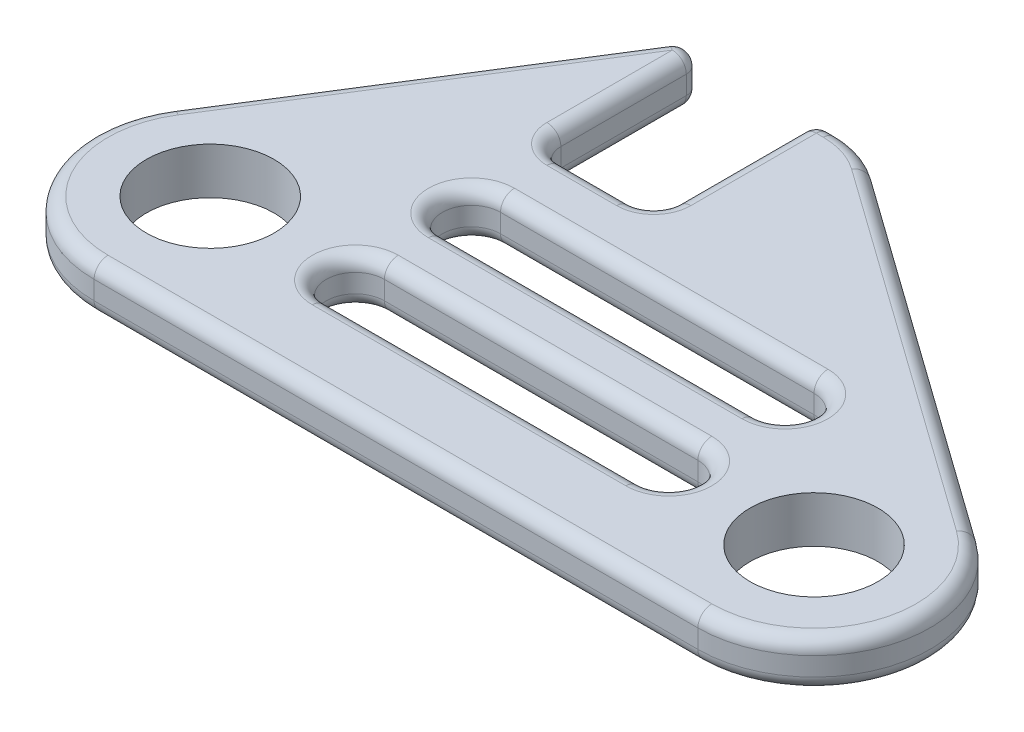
ISO-10303-21;
HEADER;
FILE_DESCRIPTION(('STEP AP214'),'2;1');
FILE_NAME('part.step','',(''),(''),'','','');
FILE_SCHEMA(('AUTOMOTIVE_DESIGN { 1 0 10303 214 1 1 1 1 }'));
ENDSEC;
DATA;
#1=APPLICATION_CONTEXT('core data for automotive mechanical design processes');
#2=APPLICATION_PROTOCOL_DEFINITION('international standard','automotive_design',2000,#1);
#3=PRODUCT_CONTEXT('',#1,'mechanical');
#4=PRODUCT('Part','Part','',(#3));
#5=PRODUCT_RELATED_PRODUCT_CATEGORY('part','',(#4));
#6=PRODUCT_DEFINITION_FORMATION('','',#4);
#7=PRODUCT_DEFINITION_CONTEXT('part definition',#1,'design');
#8=PRODUCT_DEFINITION('design','',#6,#7);
#9=PRODUCT_DEFINITION_SHAPE('','',#8);
#10=(LENGTH_UNIT() NAMED_UNIT(*) SI_UNIT(.MILLI.,.METRE.));
#11=(NAMED_UNIT(*) PLANE_ANGLE_UNIT() SI_UNIT($,.RADIAN.));
#12=(NAMED_UNIT(*) SI_UNIT($,.STERADIAN.) SOLID_ANGLE_UNIT());
#13=UNCERTAINTY_MEASURE_WITH_UNIT(LENGTH_MEASURE(1.E-05),#10,'distance_accuracy_value','');
#14=(GEOMETRIC_REPRESENTATION_CONTEXT(3) GLOBAL_UNCERTAINTY_ASSIGNED_CONTEXT((#13)) GLOBAL_UNIT_ASSIGNED_CONTEXT((#10,
#11,#12)) REPRESENTATION_CONTEXT('',''));
#15=CARTESIAN_POINT('',(0.,0.,0.));
#16=DIRECTION('',(0.,0.,1.));
#17=DIRECTION('',(1.,0.,0.));
#18=AXIS2_PLACEMENT_3D('',#15,#16,#17);
#19=CARTESIAN_POINT('',(-13.,2.,0.));
#20=DIRECTION('',(0.,1.,0.));
#21=DIRECTION('',(0.,0.,1.));
#22=AXIS2_PLACEMENT_3D('',#19,#20,#21);
#23=PLANE('',#22);
#24=DIRECTION('',(1.,0.,0.));
#25=VECTOR('',#24,1.);
#26=CARTESIAN_POINT('',(-13.,2.,-3.15));
#27=LINE('',#26,#25);
#28=CARTESIAN_POINT('',(6.74999999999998,2.,-3.15));
#29=VERTEX_POINT('',#28);
#30=CARTESIAN_POINT('',(-6.75000000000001,2.,-3.15));
#31=VERTEX_POINT('',#30);
#32=EDGE_CURVE('E578',#29,#31,#27,.F.);
#33=ORIENTED_EDGE('',*,*,#32,.T.);
#34=CARTESIAN_POINT('',(-6.75000000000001,2.,-5.));
#35=DIRECTION('',(0.,1.,0.));
#36=DIRECTION('',(0.,0.,1.));
#37=AXIS2_PLACEMENT_3D('',#34,#35,#36);
#38=CIRCLE('',#37,1.85);
#39=CARTESIAN_POINT('',(-6.75000000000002,2.,-6.85));
#40=VERTEX_POINT('',#39);
#41=EDGE_CURVE('E583',#31,#40,#38,.F.);
#42=ORIENTED_EDGE('',*,*,#41,.T.);
#43=DIRECTION('',(-1.,0.,0.));
#44=VECTOR('',#43,1.);
#45=CARTESIAN_POINT('',(-13.,2.,-6.85));
#46=LINE('',#45,#44);
#47=CARTESIAN_POINT('',(6.74999999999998,2.,-6.85));
#48=VERTEX_POINT('',#47);
#49=EDGE_CURVE('E56',#40,#48,#46,.F.);
#50=ORIENTED_EDGE('',*,*,#49,.T.);
#51=CARTESIAN_POINT('',(6.74999999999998,2.,-5.));
#52=DIRECTION('',(0.,1.,0.));
#53=DIRECTION('',(0.,0.,1.));
#54=AXIS2_PLACEMENT_3D('',#51,#52,#53);
#55=CIRCLE('',#54,1.85);
#56=EDGE_CURVE('E580',#48,#29,#55,.F.);
#57=ORIENTED_EDGE('',*,*,#56,.T.);
#58=EDGE_LOOP('',(#33,#42,#50,#57));
#59=FACE_BOUND('',#58,.T.);
#60=DIRECTION('',(-1.,0.,0.));
#61=VECTOR('',#60,1.);
#62=CARTESIAN_POINT('',(-13.,2.,-1.85));
#63=LINE('',#62,#61);
#64=CARTESIAN_POINT('',(-6.75,2.,-1.85));
#65=VERTEX_POINT('',#64);
#66=CARTESIAN_POINT('',(6.75,2.,-1.85));
#67=VERTEX_POINT('',#66);
#68=EDGE_CURVE('E569',#65,#67,#63,.F.);
#69=ORIENTED_EDGE('',*,*,#68,.T.);
#70=CARTESIAN_POINT('',(6.75,2.,0.));
#71=DIRECTION('',(0.,1.,0.));
#72=DIRECTION('',(0.,0.,1.));
#73=AXIS2_PLACEMENT_3D('',#70,#71,#72);
#74=CIRCLE('',#73,1.85);
#75=CARTESIAN_POINT('',(6.75,2.,1.85));
#76=VERTEX_POINT('',#75);
#77=EDGE_CURVE('E575',#67,#76,#74,.F.);
#78=ORIENTED_EDGE('',*,*,#77,.T.);
#79=DIRECTION('',(1.,0.,0.));
#80=VECTOR('',#79,1.);
#81=CARTESIAN_POINT('',(-13.,2.,1.85));
#82=LINE('',#81,#80);
#83=CARTESIAN_POINT('',(-6.75,2.,1.85));
#84=VERTEX_POINT('',#83);
#85=EDGE_CURVE('E573',#76,#84,#82,.F.);
#86=ORIENTED_EDGE('',*,*,#85,.T.);
#87=CARTESIAN_POINT('',(-6.75,2.,0.));
#88=DIRECTION('',(0.,1.,0.));
#89=DIRECTION('',(0.,0.,1.));
#90=AXIS2_PLACEMENT_3D('',#87,#88,#89);
#91=CIRCLE('',#90,1.85);
#92=EDGE_CURVE('E571',#84,#65,#91,.F.);
#93=ORIENTED_EDGE('',*,*,#92,.T.);
#94=EDGE_LOOP('',(#69,#78,#86,#93));
#95=FACE_BOUND('',#94,.T.);
#96=DIRECTION('',(-1.,0.,0.));
#97=VECTOR('',#96,1.);
#98=CARTESIAN_POINT('',(-6.9,2.,-8.4));
#99=LINE('',#98,#97);
#100=CARTESIAN_POINT('',(-3.9,2.,-8.4));
#101=VERTEX_POINT('',#100);
#102=CARTESIAN_POINT('',(-6.9,2.,-8.4));
#103=VERTEX_POINT('',#102);
#104=EDGE_CURVE('E440',#101,#103,#99,.T.);
#105=ORIENTED_EDGE('',*,*,#104,.T.);
#106=CARTESIAN_POINT('',(-6.9,2.,-9.99999999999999));
#107=DIRECTION('',(0.,1.,0.));
#108=DIRECTION('',(0.,0.,1.));
#109=AXIS2_PLACEMENT_3D('',#106,#107,#108);
#110=CIRCLE('',#109,1.6);
#111=CARTESIAN_POINT('',(-8.5,2.,-9.99999999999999));
#112=VERTEX_POINT('',#111);
#113=EDGE_CURVE('E442',#103,#112,#110,.F.);
#114=ORIENTED_EDGE('',*,*,#113,.T.);
#115=DIRECTION('',(0.,0.,-1.));
#116=VECTOR('',#115,1.);
#117=CARTESIAN_POINT('',(-8.5,2.,-15.4));
#118=LINE('',#117,#116);
#119=CARTESIAN_POINT('',(-8.5,2.,-15.4));
#120=VERTEX_POINT('',#119);
#121=EDGE_CURVE('E421',#112,#120,#118,.T.);
#122=ORIENTED_EDGE('',*,*,#121,.T.);
#123=DIRECTION('',(-0.532962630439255,0.,0.846138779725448));
#124=VECTOR('',#123,1.);
#125=CARTESIAN_POINT('',(-16.723010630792,2.,-2.34503557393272));
#126=LINE('',#125,#124);
#127=CARTESIAN_POINT('',(-16.723010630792,2.,-2.34503557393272));
#128=VERTEX_POINT('',#127);
#129=EDGE_CURVE('E423',#120,#128,#126,.T.);
#130=ORIENTED_EDGE('',*,*,#129,.T.);
#131=CARTESIAN_POINT('',(-13.,2.,0.));
#132=DIRECTION('',(0.,1.,0.));
#133=DIRECTION('',(0.,0.,1.));
#134=AXIS2_PLACEMENT_3D('',#131,#132,#133);
#135=CIRCLE('',#134,4.4);
#136=CARTESIAN_POINT('',(-13.,2.,4.4));
#137=VERTEX_POINT('',#136);
#138=EDGE_CURVE('E425',#128,#137,#135,.T.);
#139=ORIENTED_EDGE('',*,*,#138,.T.);
#140=DIRECTION('',(1.,0.,0.));
#141=VECTOR('',#140,1.);
#142=CARTESIAN_POINT('',(13.,2.,4.4));
#143=LINE('',#142,#141);
#144=CARTESIAN_POINT('',(13.,2.,4.4));
#145=VERTEX_POINT('',#144);
#146=EDGE_CURVE('E332',#137,#145,#143,.T.);
#147=ORIENTED_EDGE('',*,*,#146,.T.);
#148=CARTESIAN_POINT('',(13.,2.,0.));
#149=DIRECTION('',(0.,1.,0.));
#150=DIRECTION('',(0.,0.,1.));
#151=AXIS2_PLACEMENT_3D('',#148,#149,#150);
#152=CIRCLE('',#151,4.4);
#153=CARTESIAN_POINT('',(15.5550930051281,2.,-3.58210828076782));
#154=VERTEX_POINT('',#153);
#155=EDGE_CURVE('E428',#145,#154,#152,.T.);
#156=ORIENTED_EDGE('',*,*,#155,.T.);
#157=DIRECTION('',(-0.814115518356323,0.,-0.580702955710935));
#158=VECTOR('',#157,1.);
#159=CARTESIAN_POINT('',(-0.210552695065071,2.,-14.8276340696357));
#160=LINE('',#159,#158);
#161=CARTESIAN_POINT('',(-0.210552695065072,2.,-14.8276340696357));
#162=VERTEX_POINT('',#161);
#163=EDGE_CURVE('E430',#154,#162,#160,.T.);
#164=ORIENTED_EDGE('',*,*,#163,.T.);
#165=CARTESIAN_POINT('',(-1.99862335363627,2.,-12.3208514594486));
#166=DIRECTION('',(0.,1.,0.));
#167=DIRECTION('',(0.,0.,1.));
#168=AXIS2_PLACEMENT_3D('',#165,#166,#167);
#169=CIRCLE('',#168,3.07914854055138);
#170=CARTESIAN_POINT('',(-1.99862335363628,2.,-15.4));
#171=VERTEX_POINT('',#170);
#172=EDGE_CURVE('E432',#162,#171,#169,.T.);
#173=ORIENTED_EDGE('',*,*,#172,.T.);
#174=DIRECTION('',(-1.,0.,0.));
#175=VECTOR('',#174,1.);
#176=CARTESIAN_POINT('',(-2.30000000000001,2.,-15.4));
#177=LINE('',#176,#175);
#178=CARTESIAN_POINT('',(-2.30000000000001,2.,-15.4));
#179=VERTEX_POINT('',#178);
#180=EDGE_CURVE('E434',#171,#179,#177,.T.);
#181=ORIENTED_EDGE('',*,*,#180,.T.);
#182=DIRECTION('',(0.,0.,1.));
#183=VECTOR('',#182,1.);
#184=CARTESIAN_POINT('',(-2.3,2.,-9.99999999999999));
#185=LINE('',#184,#183);
#186=CARTESIAN_POINT('',(-2.3,2.,-9.99999999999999));
#187=VERTEX_POINT('',#186);
#188=EDGE_CURVE('E436',#179,#187,#185,.T.);
#189=ORIENTED_EDGE('',*,*,#188,.T.);
#190=CARTESIAN_POINT('',(-3.9,2.,-9.99999999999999));
#191=DIRECTION('',(0.,1.,0.));
#192=DIRECTION('',(0.,0.,1.));
#193=AXIS2_PLACEMENT_3D('',#190,#191,#192);
#194=CIRCLE('',#193,1.6);
#195=EDGE_CURVE('E438',#187,#101,#194,.F.);
#196=ORIENTED_EDGE('',*,*,#195,.T.);
#197=EDGE_LOOP('',(#105,#114,#122,#130,#139,#147,#156,#164,#173,#181,#189,#196));
#198=FACE_BOUND('',#197,.T.);
#199=CARTESIAN_POINT('',(13.,2.,0.));
#200=DIRECTION('',(0.,1.,0.));
#201=DIRECTION('',(0.,0.,1.));
#202=AXIS2_PLACEMENT_3D('',#199,#200,#201);
#203=CIRCLE('',#202,2.75);
#204=CARTESIAN_POINT('',(13.,2.,2.75));
#205=VERTEX_POINT('',#204);
#206=EDGE_CURVE('E667',#205,#205,#203,.T.);
#207=ORIENTED_EDGE('',*,*,#206,.F.);
#208=EDGE_LOOP('',(#207));
#209=FACE_BOUND('',#208,.T.);
#210=CARTESIAN_POINT('',(-13.,2.,0.));
#211=DIRECTION('',(0.,1.,0.));
#212=DIRECTION('',(0.,0.,-1.));
#213=AXIS2_PLACEMENT_3D('',#210,#211,#212);
#214=CIRCLE('',#213,2.75);
#215=CARTESIAN_POINT('',(-13.,2.,-2.75));
#216=VERTEX_POINT('',#215);
#217=EDGE_CURVE('E658',#216,#216,#214,.T.);
#218=ORIENTED_EDGE('',*,*,#217,.F.);
#219=EDGE_LOOP('',(#218));
#220=FACE_BOUND('',#219,.T.);
#221=ADVANCED_FACE('F32',(#59,#95,#198,#209,#220),#23,.T.);
#222=CARTESIAN_POINT('',(-13.,0.,0.));
#223=DIRECTION('',(0.,1.,0.));
#224=DIRECTION('',(0.,0.,1.));
#225=AXIS2_PLACEMENT_3D('',#222,#223,#224);
#226=PLANE('',#225);
#227=CARTESIAN_POINT('',(6.74999999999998,0.,-5.));
#228=DIRECTION('',(0.,1.,0.));
#229=DIRECTION('',(0.,0.,1.));
#230=AXIS2_PLACEMENT_3D('',#227,#228,#229);
#231=CIRCLE('',#230,1.85);
#232=CARTESIAN_POINT('',(6.74999999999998,0.,-3.15));
#233=VERTEX_POINT('',#232);
#234=CARTESIAN_POINT('',(6.74999999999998,0.,-6.85));
#235=VERTEX_POINT('',#234);
#236=EDGE_CURVE('E532',#233,#235,#231,.T.);
#237=ORIENTED_EDGE('',*,*,#236,.T.);
#238=DIRECTION('',(-1.,0.,0.));
#239=VECTOR('',#238,1.);
#240=CARTESIAN_POINT('',(-6.75000000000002,0.,-6.85));
#241=LINE('',#240,#239);
#242=CARTESIAN_POINT('',(-6.75000000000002,0.,-6.85));
#243=VERTEX_POINT('',#242);
#244=EDGE_CURVE('E534',#235,#243,#241,.T.);
#245=ORIENTED_EDGE('',*,*,#244,.T.);
#246=CARTESIAN_POINT('',(-6.75000000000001,0.,-5.));
#247=DIRECTION('',(0.,1.,0.));
#248=DIRECTION('',(0.,0.,1.));
#249=AXIS2_PLACEMENT_3D('',#246,#247,#248);
#250=CIRCLE('',#249,1.85);
#251=CARTESIAN_POINT('',(-6.75000000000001,0.,-3.15));
#252=VERTEX_POINT('',#251);
#253=EDGE_CURVE('E528',#243,#252,#250,.T.);
#254=ORIENTED_EDGE('',*,*,#253,.T.);
#255=DIRECTION('',(1.,0.,0.));
#256=VECTOR('',#255,1.);
#257=CARTESIAN_POINT('',(6.74999999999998,0.,-3.15));
#258=LINE('',#257,#256);
#259=EDGE_CURVE('E530',#252,#233,#258,.T.);
#260=ORIENTED_EDGE('',*,*,#259,.T.);
#261=EDGE_LOOP('',(#237,#245,#254,#260));
#262=FACE_BOUND('',#261,.T.);
#263=CARTESIAN_POINT('',(6.75,0.,0.));
#264=DIRECTION('',(0.,1.,0.));
#265=DIRECTION('',(0.,0.,1.));
#266=AXIS2_PLACEMENT_3D('',#263,#264,#265);
#267=CIRCLE('',#266,1.85);
#268=CARTESIAN_POINT('',(6.75,0.,1.85));
#269=VERTEX_POINT('',#268);
#270=CARTESIAN_POINT('',(6.75,0.,-1.85));
#271=VERTEX_POINT('',#270);
#272=EDGE_CURVE('E523',#269,#271,#267,.T.);
#273=ORIENTED_EDGE('',*,*,#272,.T.);
#274=DIRECTION('',(-1.,0.,0.));
#275=VECTOR('',#274,1.);
#276=CARTESIAN_POINT('',(-6.75,0.,-1.85));
#277=LINE('',#276,#275);
#278=CARTESIAN_POINT('',(-6.75,0.,-1.85));
#279=VERTEX_POINT('',#278);
#280=EDGE_CURVE('E525',#271,#279,#277,.T.);
#281=ORIENTED_EDGE('',*,*,#280,.T.);
#282=CARTESIAN_POINT('',(-6.75,0.,0.));
#283=DIRECTION('',(0.,1.,0.));
#284=DIRECTION('',(0.,0.,1.));
#285=AXIS2_PLACEMENT_3D('',#282,#283,#284);
#286=CIRCLE('',#285,1.85);
#287=CARTESIAN_POINT('',(-6.75,0.,1.85));
#288=VERTEX_POINT('',#287);
#289=EDGE_CURVE('E315',#279,#288,#286,.T.);
#290=ORIENTED_EDGE('',*,*,#289,.T.);
#291=DIRECTION('',(1.,0.,0.));
#292=VECTOR('',#291,1.);
#293=CARTESIAN_POINT('',(6.75,0.,1.85));
#294=LINE('',#293,#292);
#295=EDGE_CURVE('E521',#288,#269,#294,.T.);
#296=ORIENTED_EDGE('',*,*,#295,.T.);
#297=EDGE_LOOP('',(#273,#281,#290,#296));
#298=FACE_BOUND('',#297,.T.);
#299=DIRECTION('',(1.,0.,0.));
#300=VECTOR('',#299,1.);
#301=CARTESIAN_POINT('',(-13.,0.,4.4));
#302=LINE('',#301,#300);
#303=CARTESIAN_POINT('',(13.,0.,4.4));
#304=VERTEX_POINT('',#303);
#305=CARTESIAN_POINT('',(-13.,0.,4.4));
#306=VERTEX_POINT('',#305);
#307=EDGE_CURVE('E344',#304,#306,#302,.F.);
#308=ORIENTED_EDGE('',*,*,#307,.T.);
#309=CARTESIAN_POINT('',(-13.,0.,0.));
#310=DIRECTION('',(0.,1.,0.));
#311=DIRECTION('',(0.,0.,1.));
#312=AXIS2_PLACEMENT_3D('',#309,#310,#311);
#313=CIRCLE('',#312,4.4);
#314=CARTESIAN_POINT('',(-16.723010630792,0.,-2.34503557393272));
#315=VERTEX_POINT('',#314);
#316=EDGE_CURVE('E369',#306,#315,#313,.F.);
#317=ORIENTED_EDGE('',*,*,#316,.T.);
#318=DIRECTION('',(-0.532962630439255,0.,0.846138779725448));
#319=VECTOR('',#318,1.);
#320=CARTESIAN_POINT('',(-16.723010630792,0.,-2.34503557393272));
#321=LINE('',#320,#319);
#322=CARTESIAN_POINT('',(-8.5,0.,-15.4));
#323=VERTEX_POINT('',#322);
#324=EDGE_CURVE('E367',#315,#323,#321,.F.);
#325=ORIENTED_EDGE('',*,*,#324,.T.);
#326=DIRECTION('',(0.,0.,-1.));
#327=VECTOR('',#326,1.);
#328=CARTESIAN_POINT('',(-8.50000000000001,0.,0.));
#329=LINE('',#328,#327);
#330=CARTESIAN_POINT('',(-8.5,0.,-9.99999999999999));
#331=VERTEX_POINT('',#330);
#332=EDGE_CURVE('E365',#323,#331,#329,.F.);
#333=ORIENTED_EDGE('',*,*,#332,.T.);
#334=CARTESIAN_POINT('',(-6.9,0.,-9.99999999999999));
#335=DIRECTION('',(0.,1.,0.));
#336=DIRECTION('',(0.,0.,1.));
#337=AXIS2_PLACEMENT_3D('',#334,#335,#336);
#338=CIRCLE('',#337,1.6);
#339=CARTESIAN_POINT('',(-6.9,0.,-8.4));
#340=VERTEX_POINT('',#339);
#341=EDGE_CURVE('E363',#331,#340,#338,.T.);
#342=ORIENTED_EDGE('',*,*,#341,.T.);
#343=DIRECTION('',(-1.,0.,0.));
#344=VECTOR('',#343,1.);
#345=CARTESIAN_POINT('',(-13.,0.,-8.4));
#346=LINE('',#345,#344);
#347=CARTESIAN_POINT('',(-3.9,0.,-8.4));
#348=VERTEX_POINT('',#347);
#349=EDGE_CURVE('E361',#340,#348,#346,.F.);
#350=ORIENTED_EDGE('',*,*,#349,.T.);
#351=CARTESIAN_POINT('',(-3.9,0.,-9.99999999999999));
#352=DIRECTION('',(0.,1.,0.));
#353=DIRECTION('',(0.,0.,1.));
#354=AXIS2_PLACEMENT_3D('',#351,#352,#353);
#355=CIRCLE('',#354,1.6);
#356=CARTESIAN_POINT('',(-2.3,0.,-9.99999999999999));
#357=VERTEX_POINT('',#356);
#358=EDGE_CURVE('E359',#348,#357,#355,.T.);
#359=ORIENTED_EDGE('',*,*,#358,.T.);
#360=DIRECTION('',(0.,0.,1.));
#361=VECTOR('',#360,1.);
#362=CARTESIAN_POINT('',(-2.3,0.,0.));
#363=LINE('',#362,#361);
#364=CARTESIAN_POINT('',(-2.30000000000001,0.,-15.4));
#365=VERTEX_POINT('',#364);
#366=EDGE_CURVE('E357',#357,#365,#363,.F.);
#367=ORIENTED_EDGE('',*,*,#366,.T.);
#368=DIRECTION('',(-1.,0.,0.));
#369=VECTOR('',#368,1.);
#370=CARTESIAN_POINT('',(-12.9999999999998,0.,-15.4000000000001));
#371=LINE('',#370,#369);
#372=CARTESIAN_POINT('',(-1.99862335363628,0.,-15.4));
#373=VERTEX_POINT('',#372);
#374=EDGE_CURVE('E355',#365,#373,#371,.F.);
#375=ORIENTED_EDGE('',*,*,#374,.T.);
#376=CARTESIAN_POINT('',(-1.99862335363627,0.,-12.3208514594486));
#377=DIRECTION('',(0.,1.,0.));
#378=DIRECTION('',(0.,0.,1.));
#379=AXIS2_PLACEMENT_3D('',#376,#377,#378);
#380=CIRCLE('',#379,3.07914854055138);
#381=CARTESIAN_POINT('',(-0.210552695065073,0.,-14.8276340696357));
#382=VERTEX_POINT('',#381);
#383=EDGE_CURVE('E353',#373,#382,#380,.F.);
#384=ORIENTED_EDGE('',*,*,#383,.T.);
#385=DIRECTION('',(-0.814115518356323,0.,-0.580702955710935));
#386=VECTOR('',#385,1.);
#387=CARTESIAN_POINT('',(-1.67729300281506,0.,-15.8738497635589));
#388=LINE('',#387,#386);
#389=CARTESIAN_POINT('',(15.5550930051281,0.,-3.58210828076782));
#390=VERTEX_POINT('',#389);
#391=EDGE_CURVE('E351',#382,#390,#388,.F.);
#392=ORIENTED_EDGE('',*,*,#391,.T.);
#393=CARTESIAN_POINT('',(13.,0.,0.));
#394=DIRECTION('',(0.,1.,0.));
#395=DIRECTION('',(0.,0.,1.));
#396=AXIS2_PLACEMENT_3D('',#393,#394,#395);
#397=CIRCLE('',#396,4.4);
#398=EDGE_CURVE('E349',#390,#304,#397,.F.);
#399=ORIENTED_EDGE('',*,*,#398,.T.);
#400=EDGE_LOOP('',(#308,#317,#325,#333,#342,#350,#359,#367,#375,#384,#392,#399));
#401=FACE_BOUND('',#400,.T.);
#402=CARTESIAN_POINT('',(13.,0.,0.));
#403=DIRECTION('',(0.,1.,0.));
#404=DIRECTION('',(0.,0.,1.));
#405=AXIS2_PLACEMENT_3D('',#402,#403,#404);
#406=CIRCLE('',#405,2.75);
#407=CARTESIAN_POINT('',(13.,0.,2.75));
#408=VERTEX_POINT('',#407);
#409=EDGE_CURVE('E665',#408,#408,#406,.T.);
#410=ORIENTED_EDGE('',*,*,#409,.T.);
#411=EDGE_LOOP('',(#410));
#412=FACE_BOUND('',#411,.T.);
#413=CARTESIAN_POINT('',(-13.,0.,0.));
#414=DIRECTION('',(0.,1.,0.));
#415=DIRECTION('',(0.,0.,-1.));
#416=AXIS2_PLACEMENT_3D('',#413,#414,#415);
#417=CIRCLE('',#416,2.75);
#418=CARTESIAN_POINT('',(-13.,0.,-2.75));
#419=VERTEX_POINT('',#418);
#420=EDGE_CURVE('E654',#419,#419,#417,.T.);
#421=ORIENTED_EDGE('',*,*,#420,.T.);
#422=EDGE_LOOP('',(#421));
#423=FACE_BOUND('',#422,.T.);
#424=ADVANCED_FACE('F723',(#262,#298,#401,#412,#423),#226,.F.);
#425=CARTESIAN_POINT('',(-13.,2.,0.));
#426=DIRECTION('',(0.,-1.,0.));
#427=DIRECTION('',(0.,0.,-1.));
#428=AXIS2_PLACEMENT_3D('',#425,#426,#427);
#429=CYLINDRICAL_SURFACE('',#428,5.);
#430=DIRECTION('',(0.,-1.,0.));
#431=VECTOR('',#430,1.);
#432=CARTESIAN_POINT('',(-17.2306938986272,2.,-2.66481315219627));
#433=LINE('',#432,#431);
#434=CARTESIAN_POINT('',(-17.2306938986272,1.4,-2.66481315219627));
#435=VERTEX_POINT('',#434);
#436=CARTESIAN_POINT('',(-17.2306938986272,0.6,-2.66481315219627));
#437=VERTEX_POINT('',#436);
#438=EDGE_CURVE('E670',#435,#437,#433,.T.);
#439=ORIENTED_EDGE('',*,*,#438,.T.);
#440=CARTESIAN_POINT('',(-13.,0.6,0.));
#441=DIRECTION('',(0.,1.,0.));
#442=DIRECTION('',(0.,0.,1.));
#443=AXIS2_PLACEMENT_3D('',#440,#441,#442);
#444=CIRCLE('',#443,5.);
#445=CARTESIAN_POINT('',(-13.,0.6,5.));
#446=VERTEX_POINT('',#445);
#447=EDGE_CURVE('E326',#437,#446,#444,.T.);
#448=ORIENTED_EDGE('',*,*,#447,.T.);
#449=DIRECTION('',(0.,-1.,0.));
#450=VECTOR('',#449,1.);
#451=CARTESIAN_POINT('',(-13.,2.,5.));
#452=LINE('',#451,#450);
#453=CARTESIAN_POINT('',(-13.,1.4,5.));
#454=VERTEX_POINT('',#453);
#455=EDGE_CURVE('E308',#454,#446,#452,.T.);
#456=ORIENTED_EDGE('',*,*,#455,.F.);
#457=CARTESIAN_POINT('',(-13.,1.4,0.));
#458=DIRECTION('',(0.,1.,0.));
#459=DIRECTION('',(0.,0.,1.));
#460=AXIS2_PLACEMENT_3D('',#457,#458,#459);
#461=CIRCLE('',#460,5.);
#462=EDGE_CURVE('E323',#454,#435,#461,.F.);
#463=ORIENTED_EDGE('',*,*,#462,.T.);
#464=EDGE_LOOP('',(#439,#448,#456,#463));
#465=FACE_BOUND('',#464,.T.);
#466=ADVANCED_FACE('F321',(#465),#429,.T.);
#467=CARTESIAN_POINT('',(13.,2.,5.));
#468=DIRECTION('',(0.,0.,-1.));
#469=DIRECTION('',(-1.,0.,0.));
#470=AXIS2_PLACEMENT_3D('',#467,#468,#469);
#471=PLANE('',#470);
#472=DIRECTION('',(0.,-1.,0.));
#473=VECTOR('',#472,1.);
#474=CARTESIAN_POINT('',(13.,2.,5.));
#475=LINE('',#474,#473);
#476=CARTESIAN_POINT('',(13.,1.4,5.));
#477=VERTEX_POINT('',#476);
#478=CARTESIAN_POINT('',(13.,0.6,5.));
#479=VERTEX_POINT('',#478);
#480=EDGE_CURVE('E310',#477,#479,#475,.T.);
#481=ORIENTED_EDGE('',*,*,#480,.F.);
#482=DIRECTION('',(1.,0.,0.));
#483=VECTOR('',#482,1.);
#484=CARTESIAN_POINT('',(-13.,1.4,5.));
#485=LINE('',#484,#483);
#486=EDGE_CURVE('E305',#477,#454,#485,.F.);
#487=ORIENTED_EDGE('',*,*,#486,.T.);
#488=ORIENTED_EDGE('',*,*,#455,.T.);
#489=DIRECTION('',(1.,0.,0.));
#490=VECTOR('',#489,1.);
#491=CARTESIAN_POINT('',(13.,0.6,5.));
#492=LINE('',#491,#490);
#493=EDGE_CURVE('E316',#446,#479,#492,.T.);
#494=ORIENTED_EDGE('',*,*,#493,.T.);
#495=EDGE_LOOP('',(#481,#487,#488,#494));
#496=FACE_BOUND('',#495,.T.);
#497=ADVANCED_FACE('F307',(#496),#471,.F.);
#498=CARTESIAN_POINT('',(13.,2.,0.));
#499=DIRECTION('',(0.,-1.,0.));
#500=DIRECTION('',(0.,0.,-1.));
#501=AXIS2_PLACEMENT_3D('',#498,#499,#500);
#502=CYLINDRICAL_SURFACE('',#501,5.);
#503=ORIENTED_EDGE('',*,*,#480,.T.);
#504=CARTESIAN_POINT('',(13.,0.6,0.));
#505=DIRECTION('',(0.,1.,0.));
#506=DIRECTION('',(0.,0.,1.));
#507=AXIS2_PLACEMENT_3D('',#504,#505,#506);
#508=CIRCLE('',#507,5.);
#509=CARTESIAN_POINT('',(15.9035147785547,0.6,-4.07057759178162));
#510=VERTEX_POINT('',#509);
#511=EDGE_CURVE('E419',#479,#510,#508,.T.);
#512=ORIENTED_EDGE('',*,*,#511,.T.);
#513=DIRECTION('',(0.,-1.,0.));
#514=VECTOR('',#513,1.);
#515=CARTESIAN_POINT('',(15.9035147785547,2.,-4.07057759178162));
#516=LINE('',#515,#514);
#517=CARTESIAN_POINT('',(15.9035147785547,1.4,-4.07057759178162));
#518=VERTEX_POINT('',#517);
#519=EDGE_CURVE('E704',#518,#510,#516,.T.);
#520=ORIENTED_EDGE('',*,*,#519,.F.);
#521=CARTESIAN_POINT('',(13.,1.4,0.));
#522=DIRECTION('',(0.,1.,0.));
#523=DIRECTION('',(0.,0.,1.));
#524=AXIS2_PLACEMENT_3D('',#521,#522,#523);
#525=CIRCLE('',#524,5.);
#526=EDGE_CURVE('E417',#518,#477,#525,.F.);
#527=ORIENTED_EDGE('',*,*,#526,.T.);
#528=EDGE_LOOP('',(#503,#512,#520,#527));
#529=FACE_BOUND('',#528,.T.);
#530=ADVANCED_FACE('F708',(#529),#502,.T.);
#531=CARTESIAN_POINT('',(0.137869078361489,2.,-15.3161033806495));
#532=DIRECTION('',(-0.580702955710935,0.,0.814115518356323));
#533=DIRECTION('',(0.814115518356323,0.,0.580702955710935));
#534=AXIS2_PLACEMENT_3D('',#531,#532,#533);
#535=PLANE('',#534);
#536=ORIENTED_EDGE('',*,*,#519,.T.);
#537=DIRECTION('',(-0.814115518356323,0.,-0.580702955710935));
#538=VECTOR('',#537,1.);
#539=CARTESIAN_POINT('',(0.137869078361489,0.6,-15.3161033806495));
#540=LINE('',#539,#538);
#541=CARTESIAN_POINT('',(0.137869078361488,0.6,-15.3161033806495));
#542=VERTEX_POINT('',#541);
#543=EDGE_CURVE('E415',#510,#542,#540,.T.);
#544=ORIENTED_EDGE('',*,*,#543,.T.);
#545=DIRECTION('',(0.,-1.,0.));
#546=VECTOR('',#545,1.);
#547=CARTESIAN_POINT('',(0.137869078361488,2.,-15.3161033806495));
#548=LINE('',#547,#546);
#549=CARTESIAN_POINT('',(0.137869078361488,1.4,-15.3161033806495));
#550=VERTEX_POINT('',#549);
#551=EDGE_CURVE('E701',#550,#542,#548,.T.);
#552=ORIENTED_EDGE('',*,*,#551,.F.);
#553=DIRECTION('',(-0.814115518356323,0.,-0.580702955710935));
#554=VECTOR('',#553,1.);
#555=CARTESIAN_POINT('',(15.9035147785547,1.4,-4.07057759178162));
#556=LINE('',#555,#554);
#557=EDGE_CURVE('E413',#550,#518,#556,.F.);
#558=ORIENTED_EDGE('',*,*,#557,.T.);
#559=EDGE_LOOP('',(#536,#544,#552,#558));
#560=FACE_BOUND('',#559,.T.);
#561=ADVANCED_FACE('F802',(#560),#535,.F.);
#562=CARTESIAN_POINT('',(-1.99862335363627,2.,-12.3208514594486));
#563=DIRECTION('',(0.,-1.,0.));
#564=DIRECTION('',(0.,0.,-1.));
#565=AXIS2_PLACEMENT_3D('',#562,#563,#564);
#566=CYLINDRICAL_SURFACE('',#565,3.67914854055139);
#567=ORIENTED_EDGE('',*,*,#551,.T.);
#568=CARTESIAN_POINT('',(-1.99862335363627,0.6,-12.3208514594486));
#569=DIRECTION('',(0.,1.,0.));
#570=DIRECTION('',(0.,0.,1.));
#571=AXIS2_PLACEMENT_3D('',#568,#569,#570);
#572=CIRCLE('',#571,3.67914854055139);
#573=CARTESIAN_POINT('',(-1.99862335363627,0.6,-16.));
#574=VERTEX_POINT('',#573);
#575=EDGE_CURVE('E411',#542,#574,#572,.T.);
#576=ORIENTED_EDGE('',*,*,#575,.T.);
#577=DIRECTION('',(0.,-1.,0.));
#578=VECTOR('',#577,1.);
#579=CARTESIAN_POINT('',(-1.99862335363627,2.,-16.));
#580=LINE('',#579,#578);
#581=CARTESIAN_POINT('',(-1.99862335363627,1.4,-16.));
#582=VERTEX_POINT('',#581);
#583=EDGE_CURVE('E698',#582,#574,#580,.T.);
#584=ORIENTED_EDGE('',*,*,#583,.F.);
#585=CARTESIAN_POINT('',(-1.99862335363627,1.4,-12.3208514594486));
#586=DIRECTION('',(0.,1.,0.));
#587=DIRECTION('',(0.,0.,1.));
#588=AXIS2_PLACEMENT_3D('',#585,#586,#587);
#589=CIRCLE('',#588,3.67914854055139);
#590=EDGE_CURVE('E409',#582,#550,#589,.F.);
#591=ORIENTED_EDGE('',*,*,#590,.T.);
#592=EDGE_LOOP('',(#567,#576,#584,#591));
#593=FACE_BOUND('',#592,.T.);
#594=ADVANCED_FACE('F805',(#593),#566,.T.);
#595=CARTESIAN_POINT('',(-2.30000000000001,2.,-16.));
#596=DIRECTION('',(0.,0.,1.));
#597=DIRECTION('',(1.,0.,0.));
#598=AXIS2_PLACEMENT_3D('',#595,#596,#597);
#599=PLANE('',#598);
#600=ORIENTED_EDGE('',*,*,#583,.T.);
#601=DIRECTION('',(-1.,0.,0.));
#602=VECTOR('',#601,1.);
#603=CARTESIAN_POINT('',(-2.30000000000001,0.6,-16.));
#604=LINE('',#603,#602);
#605=CARTESIAN_POINT('',(-2.30000000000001,0.6,-16.));
#606=VERTEX_POINT('',#605);
#607=EDGE_CURVE('E407',#574,#606,#604,.T.);
#608=ORIENTED_EDGE('',*,*,#607,.T.);
#609=DIRECTION('',(0.,-1.,0.));
#610=VECTOR('',#609,1.);
#611=CARTESIAN_POINT('',(-2.30000000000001,2.,-16.));
#612=LINE('',#611,#610);
#613=CARTESIAN_POINT('',(-2.30000000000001,1.4,-16.));
#614=VERTEX_POINT('',#613);
#615=EDGE_CURVE('E695',#614,#606,#612,.T.);
#616=ORIENTED_EDGE('',*,*,#615,.F.);
#617=DIRECTION('',(-1.,0.,0.));
#618=VECTOR('',#617,1.);
#619=CARTESIAN_POINT('',(-1.99862335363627,1.4,-16.));
#620=LINE('',#619,#618);
#621=EDGE_CURVE('E405',#614,#582,#620,.F.);
#622=ORIENTED_EDGE('',*,*,#621,.T.);
#623=EDGE_LOOP('',(#600,#608,#616,#622));
#624=FACE_BOUND('',#623,.T.);
#625=ADVANCED_FACE('F872',(#624),#599,.F.);
#626=CARTESIAN_POINT('',(-2.30000000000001,2.,-15.4));
#627=DIRECTION('',(0.,-1.,0.));
#628=DIRECTION('',(0.,0.,-1.));
#629=AXIS2_PLACEMENT_3D('',#626,#627,#628);
#630=CYLINDRICAL_SURFACE('',#629,0.600000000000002);
#631=ORIENTED_EDGE('',*,*,#615,.T.);
#632=CARTESIAN_POINT('',(-2.30000000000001,0.6,-15.4));
#633=DIRECTION('',(0.,-1.,0.));
#634=DIRECTION('',(0.,0.,-1.));
#635=AXIS2_PLACEMENT_3D('',#632,#633,#634);
#636=CIRCLE('',#635,0.600000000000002);
#637=CARTESIAN_POINT('',(-2.90000000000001,0.6,-15.4));
#638=VERTEX_POINT('',#637);
#639=EDGE_CURVE('E403',#606,#638,#636,.F.);
#640=ORIENTED_EDGE('',*,*,#639,.T.);
#641=DIRECTION('',(0.,-1.,0.));
#642=VECTOR('',#641,1.);
#643=CARTESIAN_POINT('',(-2.90000000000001,2.,-15.4));
#644=LINE('',#643,#642);
#645=CARTESIAN_POINT('',(-2.90000000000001,1.4,-15.4));
#646=VERTEX_POINT('',#645);
#647=EDGE_CURVE('E692',#646,#638,#644,.T.);
#648=ORIENTED_EDGE('',*,*,#647,.F.);
#649=CARTESIAN_POINT('',(-2.30000000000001,1.4,-15.4));
#650=DIRECTION('',(0.,-1.,0.));
#651=DIRECTION('',(0.,0.,-1.));
#652=AXIS2_PLACEMENT_3D('',#649,#650,#651);
#653=CIRCLE('',#652,0.600000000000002);
#654=EDGE_CURVE('E401',#646,#614,#653,.T.);
#655=ORIENTED_EDGE('',*,*,#654,.T.);
#656=EDGE_LOOP('',(#631,#640,#648,#655));
#657=FACE_BOUND('',#656,.T.);
#658=ADVANCED_FACE('F868',(#657),#630,.T.);
#659=CARTESIAN_POINT('',(-2.90000000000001,2.,-15.4));
#660=DIRECTION('',(1.,0.,0.));
#661=DIRECTION('',(0.,0.,-1.));
#662=AXIS2_PLACEMENT_3D('',#659,#660,#661);
#663=PLANE('',#662);
#664=ORIENTED_EDGE('',*,*,#647,.T.);
#665=DIRECTION('',(0.,0.,1.));
#666=VECTOR('',#665,1.);
#667=CARTESIAN_POINT('',(-2.90000000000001,0.6,-15.4));
#668=LINE('',#667,#666);
#669=CARTESIAN_POINT('',(-2.9,0.6,-9.99999999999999));
#670=VERTEX_POINT('',#669);
#671=EDGE_CURVE('E399',#638,#670,#668,.T.);
#672=ORIENTED_EDGE('',*,*,#671,.T.);
#673=DIRECTION('',(0.,-1.,0.));
#674=VECTOR('',#673,1.);
#675=CARTESIAN_POINT('',(-2.9,2.,-9.99999999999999));
#676=LINE('',#675,#674);
#677=CARTESIAN_POINT('',(-2.9,1.4,-9.99999999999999));
#678=VERTEX_POINT('',#677);
#679=EDGE_CURVE('E689',#678,#670,#676,.T.);
#680=ORIENTED_EDGE('',*,*,#679,.F.);
#681=DIRECTION('',(0.,0.,1.));
#682=VECTOR('',#681,1.);
#683=CARTESIAN_POINT('',(-2.90000000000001,1.4,-15.4));
#684=LINE('',#683,#682);
#685=EDGE_CURVE('E397',#678,#646,#684,.F.);
#686=ORIENTED_EDGE('',*,*,#685,.T.);
#687=EDGE_LOOP('',(#664,#672,#680,#686));
#688=FACE_BOUND('',#687,.T.);
#689=ADVANCED_FACE('F864',(#688),#663,.F.);
#690=CARTESIAN_POINT('',(-3.9,2.,-9.99999999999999));
#691=DIRECTION('',(0.,-1.,0.));
#692=DIRECTION('',(0.,0.,-1.));
#693=AXIS2_PLACEMENT_3D('',#690,#691,#692);
#694=CYLINDRICAL_SURFACE('',#693,1.);
#695=ORIENTED_EDGE('',*,*,#679,.T.);
#696=CARTESIAN_POINT('',(-3.9,0.6,-9.99999999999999));
#697=DIRECTION('',(0.,1.,0.));
#698=DIRECTION('',(0.,0.,1.));
#699=AXIS2_PLACEMENT_3D('',#696,#697,#698);
#700=CIRCLE('',#699,1.);
#701=CARTESIAN_POINT('',(-3.9,0.6,-8.99999999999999));
#702=VERTEX_POINT('',#701);
#703=EDGE_CURVE('E395',#670,#702,#700,.F.);
#704=ORIENTED_EDGE('',*,*,#703,.T.);
#705=DIRECTION('',(0.,-1.,0.));
#706=VECTOR('',#705,1.);
#707=CARTESIAN_POINT('',(-3.9,2.,-8.99999999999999));
#708=LINE('',#707,#706);
#709=CARTESIAN_POINT('',(-3.9,1.4,-8.99999999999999));
#710=VERTEX_POINT('',#709);
#711=EDGE_CURVE('E686',#710,#702,#708,.T.);
#712=ORIENTED_EDGE('',*,*,#711,.F.);
#713=CARTESIAN_POINT('',(-3.9,1.4,-9.99999999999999));
#714=DIRECTION('',(0.,1.,0.));
#715=DIRECTION('',(0.,0.,1.));
#716=AXIS2_PLACEMENT_3D('',#713,#714,#715);
#717=CIRCLE('',#716,1.);
#718=EDGE_CURVE('E393',#710,#678,#717,.T.);
#719=ORIENTED_EDGE('',*,*,#718,.T.);
#720=EDGE_LOOP('',(#695,#704,#712,#719));
#721=FACE_BOUND('',#720,.T.);
#722=ADVANCED_FACE('F860',(#721),#694,.F.);
#723=CARTESIAN_POINT('',(-3.9,2.,-8.99999999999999));
#724=DIRECTION('',(0.,0.,1.));
#725=DIRECTION('',(1.,0.,0.));
#726=AXIS2_PLACEMENT_3D('',#723,#724,#725);
#727=PLANE('',#726);
#728=ORIENTED_EDGE('',*,*,#711,.T.);
#729=DIRECTION('',(-1.,0.,0.));
#730=VECTOR('',#729,1.);
#731=CARTESIAN_POINT('',(-3.9,0.6,-8.99999999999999));
#732=LINE('',#731,#730);
#733=CARTESIAN_POINT('',(-6.9,0.6,-8.99999999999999));
#734=VERTEX_POINT('',#733);
#735=EDGE_CURVE('E391',#702,#734,#732,.T.);
#736=ORIENTED_EDGE('',*,*,#735,.T.);
#737=DIRECTION('',(0.,-1.,0.));
#738=VECTOR('',#737,1.);
#739=CARTESIAN_POINT('',(-6.9,2.,-8.99999999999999));
#740=LINE('',#739,#738);
#741=CARTESIAN_POINT('',(-6.9,1.4,-8.99999999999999));
#742=VERTEX_POINT('',#741);
#743=EDGE_CURVE('E683',#742,#734,#740,.T.);
#744=ORIENTED_EDGE('',*,*,#743,.F.);
#745=DIRECTION('',(-1.,0.,0.));
#746=VECTOR('',#745,1.);
#747=CARTESIAN_POINT('',(-3.9,1.4,-8.99999999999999));
#748=LINE('',#747,#746);
#749=EDGE_CURVE('E389',#742,#710,#748,.F.);
#750=ORIENTED_EDGE('',*,*,#749,.T.);
#751=EDGE_LOOP('',(#728,#736,#744,#750));
#752=FACE_BOUND('',#751,.T.);
#753=ADVANCED_FACE('F857',(#752),#727,.F.);
#754=CARTESIAN_POINT('',(-6.9,2.,-9.99999999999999));
#755=DIRECTION('',(0.,-1.,0.));
#756=DIRECTION('',(0.,0.,-1.));
#757=AXIS2_PLACEMENT_3D('',#754,#755,#756);
#758=CYLINDRICAL_SURFACE('',#757,1.);
#759=ORIENTED_EDGE('',*,*,#743,.T.);
#760=CARTESIAN_POINT('',(-6.9,0.6,-9.99999999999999));
#761=DIRECTION('',(0.,1.,0.));
#762=DIRECTION('',(0.,0.,1.));
#763=AXIS2_PLACEMENT_3D('',#760,#761,#762);
#764=CIRCLE('',#763,1.);
#765=CARTESIAN_POINT('',(-7.9,0.6,-9.99999999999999));
#766=VERTEX_POINT('',#765);
#767=EDGE_CURVE('E387',#734,#766,#764,.F.);
#768=ORIENTED_EDGE('',*,*,#767,.T.);
#769=DIRECTION('',(0.,-1.,0.));
#770=VECTOR('',#769,1.);
#771=CARTESIAN_POINT('',(-7.9,2.,-9.99999999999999));
#772=LINE('',#771,#770);
#773=CARTESIAN_POINT('',(-7.9,1.4,-9.99999999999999));
#774=VERTEX_POINT('',#773);
#775=EDGE_CURVE('E680',#774,#766,#772,.T.);
#776=ORIENTED_EDGE('',*,*,#775,.F.);
#777=CARTESIAN_POINT('',(-6.9,1.4,-9.99999999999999));
#778=DIRECTION('',(0.,1.,0.));
#779=DIRECTION('',(0.,0.,1.));
#780=AXIS2_PLACEMENT_3D('',#777,#778,#779);
#781=CIRCLE('',#780,1.);
#782=EDGE_CURVE('E384',#774,#742,#781,.T.);
#783=ORIENTED_EDGE('',*,*,#782,.T.);
#784=EDGE_LOOP('',(#759,#768,#776,#783));
#785=FACE_BOUND('',#784,.T.);
#786=ADVANCED_FACE('F854',(#785),#758,.F.);
#787=CARTESIAN_POINT('',(-7.9,2.,-9.99999999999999));
#788=DIRECTION('',(-1.,0.,0.));
#789=DIRECTION('',(0.,0.,1.));
#790=AXIS2_PLACEMENT_3D('',#787,#788,#789);
#791=PLANE('',#790);
#792=ORIENTED_EDGE('',*,*,#775,.T.);
#793=DIRECTION('',(0.,0.,-1.));
#794=VECTOR('',#793,1.);
#795=CARTESIAN_POINT('',(-7.9,0.6,-9.99999999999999));
#796=LINE('',#795,#794);
#797=CARTESIAN_POINT('',(-7.9,0.6,-15.4));
#798=VERTEX_POINT('',#797);
#799=EDGE_CURVE('E382',#766,#798,#796,.T.);
#800=ORIENTED_EDGE('',*,*,#799,.T.);
#801=DIRECTION('',(0.,-1.,0.));
#802=VECTOR('',#801,1.);
#803=CARTESIAN_POINT('',(-7.9,2.,-15.4));
#804=LINE('',#803,#802);
#805=CARTESIAN_POINT('',(-7.9,1.4,-15.4));
#806=VERTEX_POINT('',#805);
#807=EDGE_CURVE('E677',#806,#798,#804,.T.);
#808=ORIENTED_EDGE('',*,*,#807,.F.);
#809=DIRECTION('',(0.,0.,-1.));
#810=VECTOR('',#809,1.);
#811=CARTESIAN_POINT('',(-7.9,1.4,-9.99999999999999));
#812=LINE('',#811,#810);
#813=EDGE_CURVE('E380',#806,#774,#812,.F.);
#814=ORIENTED_EDGE('',*,*,#813,.T.);
#815=EDGE_LOOP('',(#792,#800,#808,#814));
#816=FACE_BOUND('',#815,.T.);
#817=ADVANCED_FACE('F759',(#816),#791,.F.);
#818=CARTESIAN_POINT('',(-8.5,2.,-15.4));
#819=DIRECTION('',(0.,-1.,0.));
#820=DIRECTION('',(0.,0.,-1.));
#821=AXIS2_PLACEMENT_3D('',#818,#819,#820);
#822=CYLINDRICAL_SURFACE('',#821,0.600000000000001);
#823=ORIENTED_EDGE('',*,*,#807,.T.);
#824=CARTESIAN_POINT('',(-8.5,0.6,-15.4));
#825=DIRECTION('',(0.,-1.,0.));
#826=DIRECTION('',(0.,0.,-1.));
#827=AXIS2_PLACEMENT_3D('',#824,#825,#826);
#828=CIRCLE('',#827,0.600000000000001);
#829=CARTESIAN_POINT('',(-9.00768326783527,0.6,-15.7197775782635));
#830=VERTEX_POINT('',#829);
#831=EDGE_CURVE('E378',#798,#830,#828,.F.);
#832=ORIENTED_EDGE('',*,*,#831,.T.);
#833=DIRECTION('',(0.,-1.,0.));
#834=VECTOR('',#833,1.);
#835=CARTESIAN_POINT('',(-9.00768326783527,2.,-15.7197775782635));
#836=LINE('',#835,#834);
#837=CARTESIAN_POINT('',(-9.00768326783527,1.4,-15.7197775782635));
#838=VERTEX_POINT('',#837);
#839=EDGE_CURVE('E674',#838,#830,#836,.T.);
#840=ORIENTED_EDGE('',*,*,#839,.F.);
#841=CARTESIAN_POINT('',(-8.5,1.4,-15.4));
#842=DIRECTION('',(0.,-1.,0.));
#843=DIRECTION('',(0.,0.,-1.));
#844=AXIS2_PLACEMENT_3D('',#841,#842,#843);
#845=CIRCLE('',#844,0.600000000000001);
#846=EDGE_CURVE('E376',#838,#806,#845,.T.);
#847=ORIENTED_EDGE('',*,*,#846,.T.);
#848=EDGE_LOOP('',(#823,#832,#840,#847));
#849=FACE_BOUND('',#848,.T.);
#850=ADVANCED_FACE('F745',(#849),#822,.T.);
#851=CARTESIAN_POINT('',(-9.00768326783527,2.,-15.7197775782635));
#852=DIRECTION('',(0.846138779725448,0.,0.532962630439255));
#853=DIRECTION('',(0.532962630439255,0.,-0.846138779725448));
#854=AXIS2_PLACEMENT_3D('',#851,#852,#853);
#855=PLANE('',#854);
#856=ORIENTED_EDGE('',*,*,#839,.T.);
#857=DIRECTION('',(-0.532962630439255,0.,0.846138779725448));
#858=VECTOR('',#857,1.);
#859=CARTESIAN_POINT('',(-9.00768326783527,0.6,-15.7197775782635));
#860=LINE('',#859,#858);
#861=EDGE_CURVE('E374',#830,#437,#860,.T.);
#862=ORIENTED_EDGE('',*,*,#861,.T.);
#863=ORIENTED_EDGE('',*,*,#438,.F.);
#864=DIRECTION('',(-0.532962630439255,0.,0.846138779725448));
#865=VECTOR('',#864,1.);
#866=CARTESIAN_POINT('',(-9.00768326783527,1.4,-15.7197775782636));
#867=LINE('',#866,#865);
#868=EDGE_CURVE('E372',#435,#838,#867,.F.);
#869=ORIENTED_EDGE('',*,*,#868,.T.);
#870=EDGE_LOOP('',(#856,#862,#863,#869));
#871=FACE_BOUND('',#870,.T.);
#872=ADVANCED_FACE('F749',(#871),#855,.F.);
#873=CARTESIAN_POINT('',(13.,2.,0.));
#874=DIRECTION('',(0.,-1.,0.));
#875=DIRECTION('',(0.,0.,-1.));
#876=AXIS2_PLACEMENT_3D('',#873,#874,#875);
#877=CYLINDRICAL_SURFACE('',#876,2.75);
#878=ORIENTED_EDGE('',*,*,#206,.T.);
#879=EDGE_LOOP('',(#878));
#880=FACE_BOUND('',#879,.T.);
#881=ORIENTED_EDGE('',*,*,#409,.F.);
#882=EDGE_LOOP('',(#881));
#883=FACE_BOUND('',#882,.T.);
#884=ADVANCED_FACE('F845',(#880,#883),#877,.F.);
#885=CARTESIAN_POINT('',(-13.,2.,0.));
#886=DIRECTION('',(0.,-1.,0.));
#887=DIRECTION('',(0.,0.,-1.));
#888=AXIS2_PLACEMENT_3D('',#885,#886,#887);
#889=CYLINDRICAL_SURFACE('',#888,2.75);
#890=ORIENTED_EDGE('',*,*,#217,.T.);
#891=EDGE_LOOP('',(#890));
#892=FACE_BOUND('',#891,.T.);
#893=ORIENTED_EDGE('',*,*,#420,.F.);
#894=EDGE_LOOP('',(#893));
#895=FACE_BOUND('',#894,.T.);
#896=ADVANCED_FACE('F1315',(#892,#895),#889,.F.);
#897=CARTESIAN_POINT('',(6.75,2.,0.));
#898=DIRECTION('',(0.,-1.,0.));
#899=DIRECTION('',(0.,0.,-1.));
#900=AXIS2_PLACEMENT_3D('',#897,#898,#899);
#901=CYLINDRICAL_SURFACE('',#900,1.25);
#902=DIRECTION('',(0.,-1.,0.));
#903=VECTOR('',#902,1.);
#904=CARTESIAN_POINT('',(6.75,2.,-1.25));
#905=LINE('',#904,#903);
#906=CARTESIAN_POINT('',(6.75,1.4,-1.25));
#907=VERTEX_POINT('',#906);
#908=CARTESIAN_POINT('',(6.75,0.6,-1.25));
#909=VERTEX_POINT('',#908);
#910=EDGE_CURVE('E649',#907,#909,#905,.T.);
#911=ORIENTED_EDGE('',*,*,#910,.T.);
#912=CARTESIAN_POINT('',(6.75,0.6,0.));
#913=DIRECTION('',(0.,1.,0.));
#914=DIRECTION('',(0.,0.,1.));
#915=AXIS2_PLACEMENT_3D('',#912,#913,#914);
#916=CIRCLE('',#915,1.25);
#917=CARTESIAN_POINT('',(6.75,0.6,1.25));
#918=VERTEX_POINT('',#917);
#919=EDGE_CURVE('E558',#909,#918,#916,.F.);
#920=ORIENTED_EDGE('',*,*,#919,.T.);
#921=DIRECTION('',(0.,-1.,0.));
#922=VECTOR('',#921,1.);
#923=CARTESIAN_POINT('',(6.75,2.,1.25));
#924=LINE('',#923,#922);
#925=CARTESIAN_POINT('',(6.75,1.4,1.25));
#926=VERTEX_POINT('',#925);
#927=EDGE_CURVE('E651',#926,#918,#924,.T.);
#928=ORIENTED_EDGE('',*,*,#927,.F.);
#929=CARTESIAN_POINT('',(6.75,1.4,0.));
#930=DIRECTION('',(0.,1.,0.));
#931=DIRECTION('',(0.,0.,1.));
#932=AXIS2_PLACEMENT_3D('',#929,#930,#931);
#933=CIRCLE('',#932,1.25);
#934=EDGE_CURVE('E555',#926,#907,#933,.T.);
#935=ORIENTED_EDGE('',*,*,#934,.T.);
#936=EDGE_LOOP('',(#911,#920,#928,#935));
#937=FACE_BOUND('',#936,.T.);
#938=ADVANCED_FACE('F648',(#937),#901,.F.);
#939=CARTESIAN_POINT('',(-6.75,2.,-1.25));
#940=DIRECTION('',(0.,0.,1.));
#941=DIRECTION('',(1.,0.,0.));
#942=AXIS2_PLACEMENT_3D('',#939,#940,#941);
#943=PLANE('',#942);
#944=DIRECTION('',(0.,-1.,0.));
#945=VECTOR('',#944,1.);
#946=CARTESIAN_POINT('',(-6.75,2.,-1.25));
#947=LINE('',#946,#945);
#948=CARTESIAN_POINT('',(-6.75,1.4,-1.25));
#949=VERTEX_POINT('',#948);
#950=CARTESIAN_POINT('',(-6.75,0.6,-1.25));
#951=VERTEX_POINT('',#950);
#952=EDGE_CURVE('E655',#949,#951,#947,.T.);
#953=ORIENTED_EDGE('',*,*,#952,.T.);
#954=DIRECTION('',(-1.,0.,0.));
#955=VECTOR('',#954,1.);
#956=CARTESIAN_POINT('',(6.75,0.6,-1.25));
#957=LINE('',#956,#955);
#958=EDGE_CURVE('E552',#951,#909,#957,.F.);
#959=ORIENTED_EDGE('',*,*,#958,.T.);
#960=ORIENTED_EDGE('',*,*,#910,.F.);
#961=DIRECTION('',(-1.,0.,0.));
#962=VECTOR('',#961,1.);
#963=CARTESIAN_POINT('',(-6.75,1.4,-1.25));
#964=LINE('',#963,#962);
#965=EDGE_CURVE('E550',#907,#949,#964,.T.);
#966=ORIENTED_EDGE('',*,*,#965,.T.);
#967=EDGE_LOOP('',(#953,#959,#960,#966));
#968=FACE_BOUND('',#967,.T.);
#969=ADVANCED_FACE('F652',(#968),#943,.T.);
#970=CARTESIAN_POINT('',(-6.75,2.,0.));
#971=DIRECTION('',(0.,-1.,0.));
#972=DIRECTION('',(0.,0.,-1.));
#973=AXIS2_PLACEMENT_3D('',#970,#971,#972);
#974=CYLINDRICAL_SURFACE('',#973,1.25);
#975=ORIENTED_EDGE('',*,*,#952,.F.);
#976=CARTESIAN_POINT('',(-6.75,1.4,0.));
#977=DIRECTION('',(0.,1.,0.));
#978=DIRECTION('',(0.,0.,1.));
#979=AXIS2_PLACEMENT_3D('',#976,#977,#978);
#980=CIRCLE('',#979,1.25);
#981=CARTESIAN_POINT('',(-6.75,1.4,1.25));
#982=VERTEX_POINT('',#981);
#983=EDGE_CURVE('E11',#949,#982,#980,.T.);
#984=ORIENTED_EDGE('',*,*,#983,.T.);
#985=DIRECTION('',(0.,-1.,0.));
#986=VECTOR('',#985,1.);
#987=CARTESIAN_POINT('',(-6.75,2.,1.25));
#988=LINE('',#987,#986);
#989=CARTESIAN_POINT('',(-6.75,0.6,1.25));
#990=VERTEX_POINT('',#989);
#991=EDGE_CURVE('E660',#982,#990,#988,.T.);
#992=ORIENTED_EDGE('',*,*,#991,.T.);
#993=CARTESIAN_POINT('',(-6.75,0.6,0.));
#994=DIRECTION('',(0.,1.,0.));
#995=DIRECTION('',(0.,0.,1.));
#996=AXIS2_PLACEMENT_3D('',#993,#994,#995);
#997=CIRCLE('',#996,1.25);
#998=EDGE_CURVE('E41',#990,#951,#997,.F.);
#999=ORIENTED_EDGE('',*,*,#998,.T.);
#1000=EDGE_LOOP('',(#975,#984,#992,#999));
#1001=FACE_BOUND('',#1000,.T.);
#1002=ADVANCED_FACE('F1291',(#1001),#974,.F.);
#1003=CARTESIAN_POINT('',(-6.75,2.,1.25));
#1004=DIRECTION('',(0.,0.,-1.));
#1005=DIRECTION('',(-1.,0.,0.));
#1006=AXIS2_PLACEMENT_3D('',#1003,#1004,#1005);
#1007=PLANE('',#1006);
#1008=ORIENTED_EDGE('',*,*,#927,.T.);
#1009=DIRECTION('',(1.,0.,0.));
#1010=VECTOR('',#1009,1.);
#1011=CARTESIAN_POINT('',(-6.75,0.6,1.25));
#1012=LINE('',#1011,#1010);
#1013=EDGE_CURVE('E562',#918,#990,#1012,.F.);
#1014=ORIENTED_EDGE('',*,*,#1013,.T.);
#1015=ORIENTED_EDGE('',*,*,#991,.F.);
#1016=DIRECTION('',(1.,0.,0.));
#1017=VECTOR('',#1016,1.);
#1018=CARTESIAN_POINT('',(-6.75,1.4,1.25));
#1019=LINE('',#1018,#1017);
#1020=EDGE_CURVE('E560',#982,#926,#1019,.T.);
#1021=ORIENTED_EDGE('',*,*,#1020,.T.);
#1022=EDGE_LOOP('',(#1008,#1014,#1015,#1021));
#1023=FACE_BOUND('',#1022,.T.);
#1024=ADVANCED_FACE('F1282',(#1023),#1007,.T.);
#1025=CARTESIAN_POINT('',(6.74999999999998,2.,-5.));
#1026=DIRECTION('',(0.,-1.,0.));
#1027=DIRECTION('',(0.,0.,-1.));
#1028=AXIS2_PLACEMENT_3D('',#1025,#1026,#1027);
#1029=CYLINDRICAL_SURFACE('',#1028,1.25);
#1030=DIRECTION('',(0.,-1.,0.));
#1031=VECTOR('',#1030,1.);
#1032=CARTESIAN_POINT('',(6.74999999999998,2.,-6.25));
#1033=LINE('',#1032,#1031);
#1034=CARTESIAN_POINT('',(6.74999999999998,1.4,-6.25));
#1035=VERTEX_POINT('',#1034);
#1036=CARTESIAN_POINT('',(6.74999999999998,0.6,-6.25));
#1037=VERTEX_POINT('',#1036);
#1038=EDGE_CURVE('E1472',#1035,#1037,#1033,.T.);
#1039=ORIENTED_EDGE('',*,*,#1038,.T.);
#1040=CARTESIAN_POINT('',(6.74999999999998,0.6,-5.));
#1041=DIRECTION('',(0.,1.,0.));
#1042=DIRECTION('',(0.,0.,1.));
#1043=AXIS2_PLACEMENT_3D('',#1040,#1041,#1042);
#1044=CIRCLE('',#1043,1.25);
#1045=CARTESIAN_POINT('',(6.74999999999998,0.6,-3.75));
#1046=VERTEX_POINT('',#1045);
#1047=EDGE_CURVE('E544',#1037,#1046,#1044,.F.);
#1048=ORIENTED_EDGE('',*,*,#1047,.T.);
#1049=DIRECTION('',(0.,-1.,0.));
#1050=VECTOR('',#1049,1.);
#1051=CARTESIAN_POINT('',(6.74999999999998,2.,-3.75));
#1052=LINE('',#1051,#1050);
#1053=CARTESIAN_POINT('',(6.74999999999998,1.4,-3.75));
#1054=VERTEX_POINT('',#1053);
#1055=EDGE_CURVE('E487',#1054,#1046,#1052,.T.);
#1056=ORIENTED_EDGE('',*,*,#1055,.F.);
#1057=CARTESIAN_POINT('',(6.74999999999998,1.4,-5.));
#1058=DIRECTION('',(0.,1.,0.));
#1059=DIRECTION('',(0.,0.,1.));
#1060=AXIS2_PLACEMENT_3D('',#1057,#1058,#1059);
#1061=CIRCLE('',#1060,1.25);
#1062=EDGE_CURVE('E542',#1054,#1035,#1061,.T.);
#1063=ORIENTED_EDGE('',*,*,#1062,.T.);
#1064=EDGE_LOOP('',(#1039,#1048,#1056,#1063));
#1065=FACE_BOUND('',#1064,.T.);
#1066=ADVANCED_FACE('F1273',(#1065),#1029,.F.);
#1067=CARTESIAN_POINT('',(-6.75000000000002,2.,-6.25));
#1068=DIRECTION('',(0.,0.,1.));
#1069=DIRECTION('',(1.,0.,0.));
#1070=AXIS2_PLACEMENT_3D('',#1067,#1068,#1069);
#1071=PLANE('',#1070);
#1072=DIRECTION('',(0.,-1.,0.));
#1073=VECTOR('',#1072,1.);
#1074=CARTESIAN_POINT('',(-6.75000000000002,2.,-6.25));
#1075=LINE('',#1074,#1073);
#1076=CARTESIAN_POINT('',(-6.75000000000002,1.4,-6.25));
#1077=VERTEX_POINT('',#1076);
#1078=CARTESIAN_POINT('',(-6.75000000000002,0.6,-6.25));
#1079=VERTEX_POINT('',#1078);
#1080=EDGE_CURVE('E1475',#1077,#1079,#1075,.T.);
#1081=ORIENTED_EDGE('',*,*,#1080,.T.);
#1082=DIRECTION('',(-1.,0.,0.));
#1083=VECTOR('',#1082,1.);
#1084=CARTESIAN_POINT('',(6.74999999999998,0.6,-6.25));
#1085=LINE('',#1084,#1083);
#1086=EDGE_CURVE('E539',#1079,#1037,#1085,.F.);
#1087=ORIENTED_EDGE('',*,*,#1086,.T.);
#1088=ORIENTED_EDGE('',*,*,#1038,.F.);
#1089=DIRECTION('',(-1.,0.,0.));
#1090=VECTOR('',#1089,1.);
#1091=CARTESIAN_POINT('',(-6.75000000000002,1.4,-6.25));
#1092=LINE('',#1091,#1090);
#1093=EDGE_CURVE('E537',#1035,#1077,#1092,.T.);
#1094=ORIENTED_EDGE('',*,*,#1093,.T.);
#1095=EDGE_LOOP('',(#1081,#1087,#1088,#1094));
#1096=FACE_BOUND('',#1095,.T.);
#1097=ADVANCED_FACE('F1264',(#1096),#1071,.T.);
#1098=CARTESIAN_POINT('',(-6.75000000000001,2.,-5.));
#1099=DIRECTION('',(0.,-1.,0.));
#1100=DIRECTION('',(0.,0.,-1.));
#1101=AXIS2_PLACEMENT_3D('',#1098,#1099,#1100);
#1102=CYLINDRICAL_SURFACE('',#1101,1.25);
#1103=ORIENTED_EDGE('',*,*,#1080,.F.);
#1104=CARTESIAN_POINT('',(-6.75000000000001,1.4,-5.));
#1105=DIRECTION('',(0.,1.,0.));
#1106=DIRECTION('',(0.,0.,1.));
#1107=AXIS2_PLACEMENT_3D('',#1104,#1105,#1106);
#1108=CIRCLE('',#1107,1.25);
#1109=CARTESIAN_POINT('',(-6.75000000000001,1.4,-3.75));
#1110=VERTEX_POINT('',#1109);
#1111=EDGE_CURVE('E566',#1077,#1110,#1108,.T.);
#1112=ORIENTED_EDGE('',*,*,#1111,.T.);
#1113=DIRECTION('',(0.,-1.,0.));
#1114=VECTOR('',#1113,1.);
#1115=CARTESIAN_POINT('',(-6.75000000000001,2.,-3.75));
#1116=LINE('',#1115,#1114);
#1117=CARTESIAN_POINT('',(-6.75000000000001,0.6,-3.75));
#1118=VERTEX_POINT('',#1117);
#1119=EDGE_CURVE('E1480',#1110,#1118,#1116,.T.);
#1120=ORIENTED_EDGE('',*,*,#1119,.T.);
#1121=CARTESIAN_POINT('',(-6.75000000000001,0.6,-5.));
#1122=DIRECTION('',(0.,1.,0.));
#1123=DIRECTION('',(0.,0.,1.));
#1124=AXIS2_PLACEMENT_3D('',#1121,#1122,#1123);
#1125=CIRCLE('',#1124,1.25);
#1126=EDGE_CURVE('E564',#1118,#1079,#1125,.F.);
#1127=ORIENTED_EDGE('',*,*,#1126,.T.);
#1128=EDGE_LOOP('',(#1103,#1112,#1120,#1127));
#1129=FACE_BOUND('',#1128,.T.);
#1130=ADVANCED_FACE('F1255',(#1129),#1102,.F.);
#1131=CARTESIAN_POINT('',(-6.75000000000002,2.,-3.75));
#1132=DIRECTION('',(0.,0.,-1.));
#1133=DIRECTION('',(-1.,0.,0.));
#1134=AXIS2_PLACEMENT_3D('',#1131,#1132,#1133);
#1135=PLANE('',#1134);
#1136=ORIENTED_EDGE('',*,*,#1055,.T.);
#1137=DIRECTION('',(1.,0.,0.));
#1138=VECTOR('',#1137,1.);
#1139=CARTESIAN_POINT('',(-6.75000000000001,0.6,-3.75));
#1140=LINE('',#1139,#1138);
#1141=EDGE_CURVE('E548',#1046,#1118,#1140,.F.);
#1142=ORIENTED_EDGE('',*,*,#1141,.T.);
#1143=ORIENTED_EDGE('',*,*,#1119,.F.);
#1144=DIRECTION('',(1.,0.,0.));
#1145=VECTOR('',#1144,1.);
#1146=CARTESIAN_POINT('',(-6.75000000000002,1.4,-3.75));
#1147=LINE('',#1146,#1145);
#1148=EDGE_CURVE('E546',#1110,#1054,#1147,.T.);
#1149=ORIENTED_EDGE('',*,*,#1148,.T.);
#1150=EDGE_LOOP('',(#1136,#1142,#1143,#1149));
#1151=FACE_BOUND('',#1150,.T.);
#1152=ADVANCED_FACE('F915',(#1151),#1135,.T.);
#1153=CARTESIAN_POINT('',(-2.30000000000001,0.6,-15.4));
#1154=DIRECTION('',(0.,0.,1.));
#1155=DIRECTION('',(1.,0.,0.));
#1156=AXIS2_PLACEMENT_3D('',#1153,#1154,#1155);
#1157=CYLINDRICAL_SURFACE('',#1156,0.6);
#1158=CARTESIAN_POINT('',(-2.30000000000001,0.6,-15.4));
#1159=DIRECTION('',(0.,0.,-1.));
#1160=DIRECTION('',(-1.,0.,0.));
#1161=AXIS2_PLACEMENT_3D('',#1158,#1159,#1160);
#1162=CIRCLE('',#1161,0.6);
#1163=EDGE_CURVE('E481',#365,#638,#1162,.T.);
#1164=ORIENTED_EDGE('',*,*,#1163,.F.);
#1165=ORIENTED_EDGE('',*,*,#366,.F.);
#1166=CARTESIAN_POINT('',(-2.3,0.6,-9.99999999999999));
#1167=DIRECTION('',(0.,0.,1.));
#1168=DIRECTION('',(1.,0.,0.));
#1169=AXIS2_PLACEMENT_3D('',#1166,#1167,#1168);
#1170=CIRCLE('',#1169,0.6);
#1171=EDGE_CURVE('E484',#670,#357,#1170,.T.);
#1172=ORIENTED_EDGE('',*,*,#1171,.F.);
#1173=ORIENTED_EDGE('',*,*,#671,.F.);
#1174=EDGE_LOOP('',(#1164,#1165,#1172,#1173));
#1175=FACE_BOUND('',#1174,.T.);
#1176=ADVANCED_FACE('F780',(#1175),#1157,.T.);
#1177=CARTESIAN_POINT('',(-3.9,0.6,-9.99999999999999));
#1178=DIRECTION('',(0.,1.,0.));
#1179=DIRECTION('',(0.,0.,1.));
#1180=AXIS2_PLACEMENT_3D('',#1177,#1178,#1179);
#1181=TOROIDAL_SURFACE('',#1180,1.6,0.6);
#1182=ORIENTED_EDGE('',*,*,#1171,.T.);
#1183=ORIENTED_EDGE('',*,*,#358,.F.);
#1184=CARTESIAN_POINT('',(-3.9,0.6,-8.4));
#1185=DIRECTION('',(-1.,0.,0.));
#1186=DIRECTION('',(0.,0.,1.));
#1187=AXIS2_PLACEMENT_3D('',#1184,#1185,#1186);
#1188=CIRCLE('',#1187,0.6);
#1189=EDGE_CURVE('E478',#702,#348,#1188,.T.);
#1190=ORIENTED_EDGE('',*,*,#1189,.F.);
#1191=ORIENTED_EDGE('',*,*,#703,.F.);
#1192=EDGE_LOOP('',(#1182,#1183,#1190,#1191));
#1193=FACE_BOUND('',#1192,.T.);
#1194=ADVANCED_FACE('F775',(#1193),#1181,.T.);
#1195=CARTESIAN_POINT('',(-2.30000000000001,0.6,-15.4));
#1196=DIRECTION('',(0.,1.,0.));
#1197=DIRECTION('',(0.,0.,1.));
#1198=AXIS2_PLACEMENT_3D('',#1195,#1196,#1197);
#1199=SPHERICAL_SURFACE('',#1198,0.6);
#1200=ORIENTED_EDGE('',*,*,#1163,.T.);
#1201=ORIENTED_EDGE('',*,*,#639,.F.);
#1202=CARTESIAN_POINT('',(-2.30000000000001,0.6,-15.4));
#1203=DIRECTION('',(1.,0.,0.));
#1204=DIRECTION('',(0.,0.,-1.));
#1205=AXIS2_PLACEMENT_3D('',#1202,#1203,#1204);
#1206=CIRCLE('',#1205,0.6);
#1207=EDGE_CURVE('E475',#365,#606,#1206,.T.);
#1208=ORIENTED_EDGE('',*,*,#1207,.F.);
#1209=EDGE_LOOP('',(#1200,#1201,#1208));
#1210=FACE_BOUND('',#1209,.T.);
#1211=ADVANCED_FACE('F786',(#1210),#1199,.T.);
#1212=CARTESIAN_POINT('',(-3.9,0.6,-8.4));
#1213=DIRECTION('',(-1.,0.,0.));
#1214=DIRECTION('',(0.,0.,1.));
#1215=AXIS2_PLACEMENT_3D('',#1212,#1213,#1214);
#1216=CYLINDRICAL_SURFACE('',#1215,0.6);
#1217=ORIENTED_EDGE('',*,*,#1189,.T.);
#1218=ORIENTED_EDGE('',*,*,#349,.F.);
#1219=CARTESIAN_POINT('',(-6.9,0.6,-8.4));
#1220=DIRECTION('',(-1.,0.,0.));
#1221=DIRECTION('',(0.,0.,1.));
#1222=AXIS2_PLACEMENT_3D('',#1219,#1220,#1221);
#1223=CIRCLE('',#1222,0.6);
#1224=EDGE_CURVE('E472',#734,#340,#1223,.T.);
#1225=ORIENTED_EDGE('',*,*,#1224,.F.);
#1226=ORIENTED_EDGE('',*,*,#735,.F.);
#1227=EDGE_LOOP('',(#1217,#1218,#1225,#1226));
#1228=FACE_BOUND('',#1227,.T.);
#1229=ADVANCED_FACE('F770',(#1228),#1216,.T.);
#1230=CARTESIAN_POINT('',(-2.30000000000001,0.6,-15.4));
#1231=DIRECTION('',(-1.,0.,0.));
#1232=DIRECTION('',(0.,0.,1.));
#1233=AXIS2_PLACEMENT_3D('',#1230,#1231,#1232);
#1234=CYLINDRICAL_SURFACE('',#1233,0.6);
#1235=ORIENTED_EDGE('',*,*,#1207,.T.);
#1236=ORIENTED_EDGE('',*,*,#607,.F.);
#1237=CARTESIAN_POINT('',(-1.99862335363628,0.6,-15.4));
#1238=DIRECTION('',(1.,0.,0.));
#1239=DIRECTION('',(0.,0.,-1.));
#1240=AXIS2_PLACEMENT_3D('',#1237,#1238,#1239);
#1241=CIRCLE('',#1240,0.6);
#1242=EDGE_CURVE('E469',#373,#574,#1241,.T.);
#1243=ORIENTED_EDGE('',*,*,#1242,.F.);
#1244=ORIENTED_EDGE('',*,*,#374,.F.);
#1245=EDGE_LOOP('',(#1235,#1236,#1243,#1244));
#1246=FACE_BOUND('',#1245,.T.);
#1247=ADVANCED_FACE('F790',(#1246),#1234,.T.);
#1248=CARTESIAN_POINT('',(-6.9,0.6,-9.99999999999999));
#1249=DIRECTION('',(0.,1.,0.));
#1250=DIRECTION('',(0.,0.,1.));
#1251=AXIS2_PLACEMENT_3D('',#1248,#1249,#1250);
#1252=TOROIDAL_SURFACE('',#1251,1.6,0.6);
#1253=ORIENTED_EDGE('',*,*,#1224,.T.);
#1254=ORIENTED_EDGE('',*,*,#341,.F.);
#1255=CARTESIAN_POINT('',(-8.5,0.6,-9.99999999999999));
#1256=DIRECTION('',(0.,0.,-1.));
#1257=DIRECTION('',(-1.,0.,0.));
#1258=AXIS2_PLACEMENT_3D('',#1255,#1256,#1257);
#1259=CIRCLE('',#1258,0.6);
#1260=EDGE_CURVE('E466',#766,#331,#1259,.T.);
#1261=ORIENTED_EDGE('',*,*,#1260,.F.);
#1262=ORIENTED_EDGE('',*,*,#767,.F.);
#1263=EDGE_LOOP('',(#1253,#1254,#1261,#1262));
#1264=FACE_BOUND('',#1263,.T.);
#1265=ADVANCED_FACE('F765',(#1264),#1252,.T.);
#1266=CARTESIAN_POINT('',(-1.99862335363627,0.6,-12.3208514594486));
#1267=DIRECTION('',(0.,1.,0.));
#1268=DIRECTION('',(0.,0.,1.));
#1269=AXIS2_PLACEMENT_3D('',#1266,#1267,#1268);
#1270=TOROIDAL_SURFACE('',#1269,3.07914854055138,0.6);
#1271=ORIENTED_EDGE('',*,*,#1242,.T.);
#1272=ORIENTED_EDGE('',*,*,#575,.F.);
#1273=CARTESIAN_POINT('',(-0.210552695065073,0.6,-14.8276340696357));
#1274=DIRECTION('',(0.814115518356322,0.,0.580702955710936));
#1275=DIRECTION('',(0.580702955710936,0.,-0.814115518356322));
#1276=AXIS2_PLACEMENT_3D('',#1273,#1274,#1275);
#1277=CIRCLE('',#1276,0.6);
#1278=EDGE_CURVE('E463',#382,#542,#1277,.T.);
#1279=ORIENTED_EDGE('',*,*,#1278,.F.);
#1280=ORIENTED_EDGE('',*,*,#383,.F.);
#1281=EDGE_LOOP('',(#1271,#1272,#1279,#1280));
#1282=FACE_BOUND('',#1281,.T.);
#1283=ADVANCED_FACE('F796',(#1282),#1270,.T.);
#1284=CARTESIAN_POINT('',(-8.5,0.6,-9.99999999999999));
#1285=DIRECTION('',(0.,0.,-1.));
#1286=DIRECTION('',(-1.,0.,0.));
#1287=AXIS2_PLACEMENT_3D('',#1284,#1285,#1286);
#1288=CYLINDRICAL_SURFACE('',#1287,0.6);
#1289=ORIENTED_EDGE('',*,*,#1260,.T.);
#1290=ORIENTED_EDGE('',*,*,#332,.F.);
#1291=CARTESIAN_POINT('',(-8.5,0.6,-15.4));
#1292=DIRECTION('',(0.,0.,-1.));
#1293=DIRECTION('',(-1.,0.,0.));
#1294=AXIS2_PLACEMENT_3D('',#1291,#1292,#1293);
#1295=CIRCLE('',#1294,0.6);
#1296=EDGE_CURVE('E460',#798,#323,#1295,.T.);
#1297=ORIENTED_EDGE('',*,*,#1296,.F.);
#1298=ORIENTED_EDGE('',*,*,#799,.F.);
#1299=EDGE_LOOP('',(#1289,#1290,#1297,#1298));
#1300=FACE_BOUND('',#1299,.T.);
#1301=ADVANCED_FACE('F737',(#1300),#1288,.T.);
#1302=CARTESIAN_POINT('',(-0.210552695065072,0.6,-14.8276340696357));
#1303=DIRECTION('',(-0.814115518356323,0.,-0.580702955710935));
#1304=DIRECTION('',(-0.580702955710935,0.,0.814115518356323));
#1305=AXIS2_PLACEMENT_3D('',#1302,#1303,#1304);
#1306=CYLINDRICAL_SURFACE('',#1305,0.6);
#1307=ORIENTED_EDGE('',*,*,#1278,.T.);
#1308=ORIENTED_EDGE('',*,*,#543,.F.);
#1309=CARTESIAN_POINT('',(15.5550930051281,0.6,-3.58210828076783));
#1310=DIRECTION('',(0.814115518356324,0.,0.580702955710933));
#1311=DIRECTION('',(0.580702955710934,0.,-0.814115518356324));
#1312=AXIS2_PLACEMENT_3D('',#1309,#1310,#1311);
#1313=CIRCLE('',#1312,0.6);
#1314=EDGE_CURVE('E457',#390,#510,#1313,.T.);
#1315=ORIENTED_EDGE('',*,*,#1314,.F.);
#1316=ORIENTED_EDGE('',*,*,#391,.F.);
#1317=EDGE_LOOP('',(#1307,#1308,#1315,#1316));
#1318=FACE_BOUND('',#1317,.T.);
#1319=ADVANCED_FACE('F799',(#1318),#1306,.T.);
#1320=CARTESIAN_POINT('',(-8.5,0.6,-15.4));
#1321=DIRECTION('',(0.,1.,0.));
#1322=DIRECTION('',(0.,0.,1.));
#1323=AXIS2_PLACEMENT_3D('',#1320,#1321,#1322);
#1324=SPHERICAL_SURFACE('',#1323,0.6);
#1325=ORIENTED_EDGE('',*,*,#831,.F.);
#1326=ORIENTED_EDGE('',*,*,#1296,.T.);
#1327=CARTESIAN_POINT('',(-8.5,0.6,-15.4));
#1328=DIRECTION('',(-0.532962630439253,0.,0.846138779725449));
#1329=DIRECTION('',(0.846138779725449,0.,0.532962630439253));
#1330=AXIS2_PLACEMENT_3D('',#1327,#1328,#1329);
#1331=CIRCLE('',#1330,0.6);
#1332=EDGE_CURVE('E454',#830,#323,#1331,.T.);
#1333=ORIENTED_EDGE('',*,*,#1332,.F.);
#1334=EDGE_LOOP('',(#1325,#1326,#1333));
#1335=FACE_BOUND('',#1334,.T.);
#1336=ADVANCED_FACE('F742',(#1335),#1324,.T.);
#1337=CARTESIAN_POINT('',(13.,0.6,0.));
#1338=DIRECTION('',(0.,1.,0.));
#1339=DIRECTION('',(0.,0.,1.));
#1340=AXIS2_PLACEMENT_3D('',#1337,#1338,#1339);
#1341=TOROIDAL_SURFACE('',#1340,4.4,0.6);
#1342=ORIENTED_EDGE('',*,*,#1314,.T.);
#1343=ORIENTED_EDGE('',*,*,#511,.F.);
#1344=CARTESIAN_POINT('',(13.,0.6,4.4));
#1345=DIRECTION('',(-1.,0.,0.));
#1346=DIRECTION('',(0.,0.,1.));
#1347=AXIS2_PLACEMENT_3D('',#1344,#1345,#1346);
#1348=CIRCLE('',#1347,0.6);
#1349=EDGE_CURVE('E451',#304,#479,#1348,.T.);
#1350=ORIENTED_EDGE('',*,*,#1349,.F.);
#1351=ORIENTED_EDGE('',*,*,#398,.F.);
#1352=EDGE_LOOP('',(#1342,#1343,#1350,#1351));
#1353=FACE_BOUND('',#1352,.T.);
#1354=ADVANCED_FACE('F713',(#1353),#1341,.T.);
#1355=CARTESIAN_POINT('',(-8.5,0.6,-15.4));
#1356=DIRECTION('',(-0.532962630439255,0.,0.846138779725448));
#1357=DIRECTION('',(0.846138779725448,0.,0.532962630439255));
#1358=AXIS2_PLACEMENT_3D('',#1355,#1356,#1357);
#1359=CYLINDRICAL_SURFACE('',#1358,0.6);
#1360=ORIENTED_EDGE('',*,*,#1332,.T.);
#1361=ORIENTED_EDGE('',*,*,#324,.F.);
#1362=CARTESIAN_POINT('',(-16.723010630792,0.6,-2.34503557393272));
#1363=DIRECTION('',(-0.532962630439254,0.,0.846138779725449));
#1364=DIRECTION('',(0.846138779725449,0.,0.532962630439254));
#1365=AXIS2_PLACEMENT_3D('',#1362,#1363,#1364);
#1366=CIRCLE('',#1365,0.6);
#1367=EDGE_CURVE('E448',#437,#315,#1366,.T.);
#1368=ORIENTED_EDGE('',*,*,#1367,.F.);
#1369=ORIENTED_EDGE('',*,*,#861,.F.);
#1370=EDGE_LOOP('',(#1360,#1361,#1368,#1369));
#1371=FACE_BOUND('',#1370,.T.);
#1372=ADVANCED_FACE('F731',(#1371),#1359,.T.);
#1373=CARTESIAN_POINT('',(13.,0.6,4.4));
#1374=DIRECTION('',(1.,0.,0.));
#1375=DIRECTION('',(0.,0.,-1.));
#1376=AXIS2_PLACEMENT_3D('',#1373,#1374,#1375);
#1377=CYLINDRICAL_SURFACE('',#1376,0.6);
#1378=ORIENTED_EDGE('',*,*,#1349,.T.);
#1379=ORIENTED_EDGE('',*,*,#493,.F.);
#1380=CARTESIAN_POINT('',(-13.,0.6,4.4));
#1381=DIRECTION('',(-1.,0.,0.));
#1382=DIRECTION('',(0.,0.,1.));
#1383=AXIS2_PLACEMENT_3D('',#1380,#1381,#1382);
#1384=CIRCLE('',#1383,0.6);
#1385=EDGE_CURVE('E446',#306,#446,#1384,.T.);
#1386=ORIENTED_EDGE('',*,*,#1385,.F.);
#1387=ORIENTED_EDGE('',*,*,#307,.F.);
#1388=EDGE_LOOP('',(#1378,#1379,#1386,#1387));
#1389=FACE_BOUND('',#1388,.T.);
#1390=ADVANCED_FACE('F719',(#1389),#1377,.T.);
#1391=CARTESIAN_POINT('',(-13.,0.6,0.));
#1392=DIRECTION('',(0.,1.,0.));
#1393=DIRECTION('',(0.,0.,1.));
#1394=AXIS2_PLACEMENT_3D('',#1391,#1392,#1393);
#1395=TOROIDAL_SURFACE('',#1394,4.4,0.6);
#1396=ORIENTED_EDGE('',*,*,#1367,.T.);
#1397=ORIENTED_EDGE('',*,*,#316,.F.);
#1398=ORIENTED_EDGE('',*,*,#1385,.T.);
#1399=ORIENTED_EDGE('',*,*,#447,.F.);
#1400=EDGE_LOOP('',(#1396,#1397,#1398,#1399));
#1401=FACE_BOUND('',#1400,.T.);
#1402=ADVANCED_FACE('F726',(#1401),#1395,.T.);
#1403=CARTESIAN_POINT('',(-1.67729300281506,1.4,-15.8738497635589));
#1404=DIRECTION('',(0.814115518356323,0.,0.580702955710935));
#1405=DIRECTION('',(0.580702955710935,0.,-0.814115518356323));
#1406=AXIS2_PLACEMENT_3D('',#1403,#1404,#1405);
#1407=CYLINDRICAL_SURFACE('',#1406,0.6);
#1408=CARTESIAN_POINT('',(15.5550930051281,1.4,-3.58210828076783));
#1409=DIRECTION('',(0.814115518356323,0.,0.580702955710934));
#1410=DIRECTION('',(0.580702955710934,0.,-0.814115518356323));
#1411=AXIS2_PLACEMENT_3D('',#1408,#1409,#1410);
#1412=CIRCLE('',#1411,0.6);
#1413=EDGE_CURVE('E515',#518,#154,#1412,.T.);
#1414=ORIENTED_EDGE('',*,*,#1413,.F.);
#1415=ORIENTED_EDGE('',*,*,#557,.F.);
#1416=CARTESIAN_POINT('',(-0.210552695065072,1.4,-14.8276340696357));
#1417=DIRECTION('',(-0.814115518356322,0.,-0.580702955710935));
#1418=DIRECTION('',(-0.580702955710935,0.,0.814115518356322));
#1419=AXIS2_PLACEMENT_3D('',#1416,#1417,#1418);
#1420=CIRCLE('',#1419,0.6);
#1421=EDGE_CURVE('E449',#162,#550,#1420,.T.);
#1422=ORIENTED_EDGE('',*,*,#1421,.F.);
#1423=ORIENTED_EDGE('',*,*,#163,.F.);
#1424=EDGE_LOOP('',(#1414,#1415,#1422,#1423));
#1425=FACE_BOUND('',#1424,.T.);
#1426=ADVANCED_FACE('F826',(#1425),#1407,.T.);
#1427=CARTESIAN_POINT('',(-1.99862335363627,1.4,-12.3208514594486));
#1428=DIRECTION('',(0.,1.,0.));
#1429=DIRECTION('',(0.,0.,1.));
#1430=AXIS2_PLACEMENT_3D('',#1427,#1428,#1429);
#1431=TOROIDAL_SURFACE('',#1430,3.07914854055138,0.6);
#1432=ORIENTED_EDGE('',*,*,#1421,.T.);
#1433=ORIENTED_EDGE('',*,*,#590,.F.);
#1434=CARTESIAN_POINT('',(-1.99862335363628,1.4,-15.4));
#1435=DIRECTION('',(-1.,0.,0.));
#1436=DIRECTION('',(0.,0.,1.));
#1437=AXIS2_PLACEMENT_3D('',#1434,#1435,#1436);
#1438=CIRCLE('',#1437,0.6);
#1439=EDGE_CURVE('E512',#171,#582,#1438,.T.);
#1440=ORIENTED_EDGE('',*,*,#1439,.F.);
#1441=ORIENTED_EDGE('',*,*,#172,.F.);
#1442=EDGE_LOOP('',(#1432,#1433,#1440,#1441));
#1443=FACE_BOUND('',#1442,.T.);
#1444=ADVANCED_FACE('F810',(#1443),#1431,.T.);
#1445=CARTESIAN_POINT('',(13.,1.4,0.));
#1446=DIRECTION('',(0.,1.,0.));
#1447=DIRECTION('',(0.,0.,1.));
#1448=AXIS2_PLACEMENT_3D('',#1445,#1446,#1447);
#1449=TOROIDAL_SURFACE('',#1448,4.4,0.6);
#1450=ORIENTED_EDGE('',*,*,#1413,.T.);
#1451=ORIENTED_EDGE('',*,*,#155,.F.);
#1452=CARTESIAN_POINT('',(13.,1.4,4.4));
#1453=DIRECTION('',(-1.,0.,0.));
#1454=DIRECTION('',(0.,0.,1.));
#1455=AXIS2_PLACEMENT_3D('',#1452,#1453,#1454);
#1456=CIRCLE('',#1455,0.6);
#1457=EDGE_CURVE('E510',#477,#145,#1456,.T.);
#1458=ORIENTED_EDGE('',*,*,#1457,.F.);
#1459=ORIENTED_EDGE('',*,*,#526,.F.);
#1460=EDGE_LOOP('',(#1450,#1451,#1458,#1459));
#1461=FACE_BOUND('',#1460,.T.);
#1462=ADVANCED_FACE('F828',(#1461),#1449,.T.);
#1463=CARTESIAN_POINT('',(-12.9999999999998,1.4,-15.4000000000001));
#1464=DIRECTION('',(1.,0.,0.));
#1465=DIRECTION('',(0.,0.,-1.));
#1466=AXIS2_PLACEMENT_3D('',#1463,#1464,#1465);
#1467=CYLINDRICAL_SURFACE('',#1466,0.6);
#1468=ORIENTED_EDGE('',*,*,#1439,.T.);
#1469=ORIENTED_EDGE('',*,*,#621,.F.);
#1470=CARTESIAN_POINT('',(-2.30000000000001,1.4,-15.4));
#1471=DIRECTION('',(-1.,0.,0.));
#1472=DIRECTION('',(0.,0.,1.));
#1473=AXIS2_PLACEMENT_3D('',#1470,#1471,#1472);
#1474=CIRCLE('',#1473,0.6);
#1475=EDGE_CURVE('E335',#179,#614,#1474,.T.);
#1476=ORIENTED_EDGE('',*,*,#1475,.F.);
#1477=ORIENTED_EDGE('',*,*,#180,.F.);
#1478=EDGE_LOOP('',(#1468,#1469,#1476,#1477));
#1479=FACE_BOUND('',#1478,.T.);
#1480=ADVANCED_FACE('F816',(#1479),#1467,.T.);
#1481=CARTESIAN_POINT('',(-13.,1.4,4.4));
#1482=DIRECTION('',(-1.,0.,0.));
#1483=DIRECTION('',(0.,0.,1.));
#1484=AXIS2_PLACEMENT_3D('',#1481,#1482,#1483);
#1485=CYLINDRICAL_SURFACE('',#1484,0.6);
#1486=ORIENTED_EDGE('',*,*,#1457,.T.);
#1487=ORIENTED_EDGE('',*,*,#146,.F.);
#1488=CARTESIAN_POINT('',(-13.,1.4,4.4));
#1489=DIRECTION('',(-1.,0.,0.));
#1490=DIRECTION('',(0.,0.,1.));
#1491=AXIS2_PLACEMENT_3D('',#1488,#1489,#1490);
#1492=CIRCLE('',#1491,0.6);
#1493=EDGE_CURVE('E330',#454,#137,#1492,.T.);
#1494=ORIENTED_EDGE('',*,*,#1493,.F.);
#1495=ORIENTED_EDGE('',*,*,#486,.F.);
#1496=EDGE_LOOP('',(#1486,#1487,#1494,#1495));
#1497=FACE_BOUND('',#1496,.T.);
#1498=ADVANCED_FACE('F331',(#1497),#1485,.T.);
#1499=CARTESIAN_POINT('',(-2.30000000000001,1.4,-15.4));
#1500=DIRECTION('',(0.,1.,0.));
#1501=DIRECTION('',(0.,0.,1.));
#1502=AXIS2_PLACEMENT_3D('',#1499,#1500,#1501);
#1503=SPHERICAL_SURFACE('',#1502,0.6);
#1504=ORIENTED_EDGE('',*,*,#1475,.T.);
#1505=ORIENTED_EDGE('',*,*,#654,.F.);
#1506=CARTESIAN_POINT('',(-2.30000000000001,1.4,-15.4));
#1507=DIRECTION('',(0.,0.,1.));
#1508=DIRECTION('',(1.,0.,0.));
#1509=AXIS2_PLACEMENT_3D('',#1506,#1507,#1508);
#1510=CIRCLE('',#1509,0.6);
#1511=EDGE_CURVE('E336',#179,#646,#1510,.T.);
#1512=ORIENTED_EDGE('',*,*,#1511,.F.);
#1513=EDGE_LOOP('',(#1504,#1505,#1512));
#1514=FACE_BOUND('',#1513,.T.);
#1515=ADVANCED_FACE('F943',(#1514),#1503,.T.);
#1516=CARTESIAN_POINT('',(-13.,1.4,0.));
#1517=DIRECTION('',(0.,1.,0.));
#1518=DIRECTION('',(0.,0.,1.));
#1519=AXIS2_PLACEMENT_3D('',#1516,#1517,#1518);
#1520=TOROIDAL_SURFACE('',#1519,4.4,0.6);
#1521=ORIENTED_EDGE('',*,*,#1493,.T.);
#1522=ORIENTED_EDGE('',*,*,#138,.F.);
#1523=CARTESIAN_POINT('',(-16.723010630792,1.4,-2.34503557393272));
#1524=DIRECTION('',(0.532962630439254,0.,-0.846138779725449));
#1525=DIRECTION('',(-0.846138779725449,0.,-0.532962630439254));
#1526=AXIS2_PLACEMENT_3D('',#1523,#1524,#1525);
#1527=CIRCLE('',#1526,0.6);
#1528=EDGE_CURVE('E341',#435,#128,#1527,.T.);
#1529=ORIENTED_EDGE('',*,*,#1528,.F.);
#1530=ORIENTED_EDGE('',*,*,#462,.F.);
#1531=EDGE_LOOP('',(#1521,#1522,#1529,#1530));
#1532=FACE_BOUND('',#1531,.T.);
#1533=ADVANCED_FACE('F339',(#1532),#1520,.T.);
#1534=CARTESIAN_POINT('',(-2.3,1.4,0.));
#1535=DIRECTION('',(0.,0.,-1.));
#1536=DIRECTION('',(-1.,0.,0.));
#1537=AXIS2_PLACEMENT_3D('',#1534,#1535,#1536);
#1538=CYLINDRICAL_SURFACE('',#1537,0.6);
#1539=ORIENTED_EDGE('',*,*,#1511,.T.);
#1540=ORIENTED_EDGE('',*,*,#685,.F.);
#1541=CARTESIAN_POINT('',(-2.3,1.4,-9.99999999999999));
#1542=DIRECTION('',(0.,0.,1.));
#1543=DIRECTION('',(1.,0.,0.));
#1544=AXIS2_PLACEMENT_3D('',#1541,#1542,#1543);
#1545=CIRCLE('',#1544,0.6);
#1546=EDGE_CURVE('E502',#187,#678,#1545,.T.);
#1547=ORIENTED_EDGE('',*,*,#1546,.F.);
#1548=ORIENTED_EDGE('',*,*,#188,.F.);
#1549=EDGE_LOOP('',(#1539,#1540,#1547,#1548));
#1550=FACE_BOUND('',#1549,.T.);
#1551=ADVANCED_FACE('F937',(#1550),#1538,.T.);
#1552=CARTESIAN_POINT('',(-16.723010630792,1.4,-2.34503557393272));
#1553=DIRECTION('',(0.532962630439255,0.,-0.846138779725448));
#1554=DIRECTION('',(-0.846138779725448,0.,-0.532962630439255));
#1555=AXIS2_PLACEMENT_3D('',#1552,#1553,#1554);
#1556=CYLINDRICAL_SURFACE('',#1555,0.6);
#1557=ORIENTED_EDGE('',*,*,#1528,.T.);
#1558=ORIENTED_EDGE('',*,*,#129,.F.);
#1559=CARTESIAN_POINT('',(-8.5,1.4,-15.4));
#1560=DIRECTION('',(0.532962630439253,0.,-0.846138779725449));
#1561=DIRECTION('',(-0.846138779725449,0.,-0.532962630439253));
#1562=AXIS2_PLACEMENT_3D('',#1559,#1560,#1561);
#1563=CIRCLE('',#1562,0.6);
#1564=EDGE_CURVE('E499',#838,#120,#1563,.T.);
#1565=ORIENTED_EDGE('',*,*,#1564,.F.);
#1566=ORIENTED_EDGE('',*,*,#868,.F.);
#1567=EDGE_LOOP('',(#1557,#1558,#1565,#1566));
#1568=FACE_BOUND('',#1567,.T.);
#1569=ADVANCED_FACE('F751',(#1568),#1556,.T.);
#1570=CARTESIAN_POINT('',(-3.9,1.4,-9.99999999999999));
#1571=DIRECTION('',(0.,1.,0.));
#1572=DIRECTION('',(0.,0.,1.));
#1573=AXIS2_PLACEMENT_3D('',#1570,#1571,#1572);
#1574=TOROIDAL_SURFACE('',#1573,1.6,0.6);
#1575=ORIENTED_EDGE('',*,*,#1546,.T.);
#1576=ORIENTED_EDGE('',*,*,#718,.F.);
#1577=CARTESIAN_POINT('',(-3.9,1.4,-8.4));
#1578=DIRECTION('',(-1.,0.,0.));
#1579=DIRECTION('',(0.,0.,1.));
#1580=AXIS2_PLACEMENT_3D('',#1577,#1578,#1579);
#1581=CIRCLE('',#1580,0.6);
#1582=EDGE_CURVE('E496',#101,#710,#1581,.T.);
#1583=ORIENTED_EDGE('',*,*,#1582,.F.);
#1584=ORIENTED_EDGE('',*,*,#195,.F.);
#1585=EDGE_LOOP('',(#1575,#1576,#1583,#1584));
#1586=FACE_BOUND('',#1585,.T.);
#1587=ADVANCED_FACE('F931',(#1586),#1574,.T.);
#1588=CARTESIAN_POINT('',(-8.5,1.4,-15.4));
#1589=DIRECTION('',(0.,1.,0.));
#1590=DIRECTION('',(0.,0.,1.));
#1591=AXIS2_PLACEMENT_3D('',#1588,#1589,#1590);
#1592=SPHERICAL_SURFACE('',#1591,0.6);
#1593=ORIENTED_EDGE('',*,*,#846,.F.);
#1594=ORIENTED_EDGE('',*,*,#1564,.T.);
#1595=CARTESIAN_POINT('',(-8.5,1.4,-15.4));
#1596=DIRECTION('',(0.,0.,1.));
#1597=DIRECTION('',(1.,0.,0.));
#1598=AXIS2_PLACEMENT_3D('',#1595,#1596,#1597);
#1599=CIRCLE('',#1598,0.6);
#1600=EDGE_CURVE('E493',#806,#120,#1599,.T.);
#1601=ORIENTED_EDGE('',*,*,#1600,.F.);
#1602=EDGE_LOOP('',(#1593,#1594,#1601));
#1603=FACE_BOUND('',#1602,.T.);
#1604=ADVANCED_FACE('F756',(#1603),#1592,.T.);
#1605=CARTESIAN_POINT('',(-13.,1.4,-8.4));
#1606=DIRECTION('',(1.,0.,0.));
#1607=DIRECTION('',(0.,0.,-1.));
#1608=AXIS2_PLACEMENT_3D('',#1605,#1606,#1607);
#1609=CYLINDRICAL_SURFACE('',#1608,0.6);
#1610=ORIENTED_EDGE('',*,*,#1582,.T.);
#1611=ORIENTED_EDGE('',*,*,#749,.F.);
#1612=CARTESIAN_POINT('',(-6.9,1.4,-8.4));
#1613=DIRECTION('',(-1.,0.,0.));
#1614=DIRECTION('',(0.,0.,1.));
#1615=AXIS2_PLACEMENT_3D('',#1612,#1613,#1614);
#1616=CIRCLE('',#1615,0.6);
#1617=EDGE_CURVE('E490',#103,#742,#1616,.T.);
#1618=ORIENTED_EDGE('',*,*,#1617,.F.);
#1619=ORIENTED_EDGE('',*,*,#104,.F.);
#1620=EDGE_LOOP('',(#1610,#1611,#1618,#1619));
#1621=FACE_BOUND('',#1620,.T.);
#1622=ADVANCED_FACE('F924',(#1621),#1609,.T.);
#1623=CARTESIAN_POINT('',(-8.50000000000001,1.4,0.));
#1624=DIRECTION('',(0.,0.,1.));
#1625=DIRECTION('',(1.,0.,0.));
#1626=AXIS2_PLACEMENT_3D('',#1623,#1624,#1625);
#1627=CYLINDRICAL_SURFACE('',#1626,0.6);
#1628=ORIENTED_EDGE('',*,*,#1600,.T.);
#1629=ORIENTED_EDGE('',*,*,#121,.F.);
#1630=CARTESIAN_POINT('',(-8.5,1.4,-9.99999999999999));
#1631=DIRECTION('',(0.,0.,1.));
#1632=DIRECTION('',(1.,0.,0.));
#1633=AXIS2_PLACEMENT_3D('',#1630,#1631,#1632);
#1634=CIRCLE('',#1633,0.6);
#1635=EDGE_CURVE('E488',#774,#112,#1634,.T.);
#1636=ORIENTED_EDGE('',*,*,#1635,.F.);
#1637=ORIENTED_EDGE('',*,*,#813,.F.);
#1638=EDGE_LOOP('',(#1628,#1629,#1636,#1637));
#1639=FACE_BOUND('',#1638,.T.);
#1640=ADVANCED_FACE('F920',(#1639),#1627,.T.);
#1641=CARTESIAN_POINT('',(-6.9,1.4,-9.99999999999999));
#1642=DIRECTION('',(0.,1.,0.));
#1643=DIRECTION('',(0.,0.,1.));
#1644=AXIS2_PLACEMENT_3D('',#1641,#1642,#1643);
#1645=TOROIDAL_SURFACE('',#1644,1.6,0.6);
#1646=ORIENTED_EDGE('',*,*,#1617,.T.);
#1647=ORIENTED_EDGE('',*,*,#782,.F.);
#1648=ORIENTED_EDGE('',*,*,#1635,.T.);
#1649=ORIENTED_EDGE('',*,*,#113,.F.);
#1650=EDGE_LOOP('',(#1646,#1647,#1648,#1649));
#1651=FACE_BOUND('',#1650,.T.);
#1652=ADVANCED_FACE('F916',(#1651),#1645,.T.);
#1653=CARTESIAN_POINT('',(-13.,0.6,-3.15));
#1654=DIRECTION('',(-1.,0.,0.));
#1655=DIRECTION('',(0.,0.,1.));
#1656=AXIS2_PLACEMENT_3D('',#1653,#1654,#1655);
#1657=CYLINDRICAL_SURFACE('',#1656,0.6);
#1658=CARTESIAN_POINT('',(-6.75000000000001,0.6,-3.15));
#1659=DIRECTION('',(-1.,0.,0.));
#1660=DIRECTION('',(0.,0.,1.));
#1661=AXIS2_PLACEMENT_3D('',#1658,#1659,#1660);
#1662=CIRCLE('',#1661,0.6);
#1663=EDGE_CURVE('E591',#1118,#252,#1662,.T.);
#1664=ORIENTED_EDGE('',*,*,#1663,.F.);
#1665=ORIENTED_EDGE('',*,*,#1141,.F.);
#1666=CARTESIAN_POINT('',(6.74999999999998,0.6,-3.15));
#1667=DIRECTION('',(1.,0.,0.));
#1668=DIRECTION('',(0.,0.,-1.));
#1669=AXIS2_PLACEMENT_3D('',#1666,#1667,#1668);
#1670=CIRCLE('',#1669,0.6);
#1671=EDGE_CURVE('E491',#233,#1046,#1670,.T.);
#1672=ORIENTED_EDGE('',*,*,#1671,.F.);
#1673=ORIENTED_EDGE('',*,*,#259,.F.);
#1674=EDGE_LOOP('',(#1664,#1665,#1672,#1673));
#1675=FACE_BOUND('',#1674,.T.);
#1676=ADVANCED_FACE('F919',(#1675),#1657,.T.);
#1677=CARTESIAN_POINT('',(6.74999999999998,0.6,-5.));
#1678=DIRECTION('',(0.,1.,0.));
#1679=DIRECTION('',(0.,0.,1.));
#1680=AXIS2_PLACEMENT_3D('',#1677,#1678,#1679);
#1681=TOROIDAL_SURFACE('',#1680,1.85,0.6);
#1682=ORIENTED_EDGE('',*,*,#1671,.T.);
#1683=ORIENTED_EDGE('',*,*,#1047,.F.);
#1684=CARTESIAN_POINT('',(6.74999999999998,0.6,-6.85));
#1685=DIRECTION('',(-1.,0.,0.));
#1686=DIRECTION('',(0.,0.,1.));
#1687=AXIS2_PLACEMENT_3D('',#1684,#1685,#1686);
#1688=CIRCLE('',#1687,0.6);
#1689=EDGE_CURVE('E588',#235,#1037,#1688,.T.);
#1690=ORIENTED_EDGE('',*,*,#1689,.F.);
#1691=ORIENTED_EDGE('',*,*,#236,.F.);
#1692=EDGE_LOOP('',(#1682,#1683,#1690,#1691));
#1693=FACE_BOUND('',#1692,.T.);
#1694=ADVANCED_FACE('F994',(#1693),#1681,.T.);
#1695=CARTESIAN_POINT('',(-6.75000000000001,0.6,-5.));
#1696=DIRECTION('',(0.,1.,0.));
#1697=DIRECTION('',(0.,0.,1.));
#1698=AXIS2_PLACEMENT_3D('',#1695,#1696,#1697);
#1699=TOROIDAL_SURFACE('',#1698,1.85,0.6);
#1700=ORIENTED_EDGE('',*,*,#1663,.T.);
#1701=ORIENTED_EDGE('',*,*,#253,.F.);
#1702=CARTESIAN_POINT('',(-6.75000000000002,0.6,-6.85));
#1703=DIRECTION('',(1.,0.,0.));
#1704=DIRECTION('',(0.,0.,-1.));
#1705=AXIS2_PLACEMENT_3D('',#1702,#1703,#1704);
#1706=CIRCLE('',#1705,0.6);
#1707=EDGE_CURVE('E586',#1079,#243,#1706,.T.);
#1708=ORIENTED_EDGE('',*,*,#1707,.F.);
#1709=ORIENTED_EDGE('',*,*,#1126,.F.);
#1710=EDGE_LOOP('',(#1700,#1701,#1708,#1709));
#1711=FACE_BOUND('',#1710,.T.);
#1712=ADVANCED_FACE('F1003',(#1711),#1699,.T.);
#1713=CARTESIAN_POINT('',(-13.,0.6,-6.85));
#1714=DIRECTION('',(1.,0.,0.));
#1715=DIRECTION('',(0.,0.,-1.));
#1716=AXIS2_PLACEMENT_3D('',#1713,#1714,#1715);
#1717=CYLINDRICAL_SURFACE('',#1716,0.6);
#1718=ORIENTED_EDGE('',*,*,#1689,.T.);
#1719=ORIENTED_EDGE('',*,*,#1086,.F.);
#1720=ORIENTED_EDGE('',*,*,#1707,.T.);
#1721=ORIENTED_EDGE('',*,*,#244,.F.);
#1722=EDGE_LOOP('',(#1718,#1719,#1720,#1721));
#1723=FACE_BOUND('',#1722,.T.);
#1724=ADVANCED_FACE('F1011',(#1723),#1717,.T.);
#1725=CARTESIAN_POINT('',(-13.,0.6,1.85));
#1726=DIRECTION('',(-1.,0.,0.));
#1727=DIRECTION('',(0.,0.,1.));
#1728=AXIS2_PLACEMENT_3D('',#1725,#1726,#1727);
#1729=CYLINDRICAL_SURFACE('',#1728,0.6);
#1730=CARTESIAN_POINT('',(-6.75,0.6,1.85));
#1731=DIRECTION('',(-1.,0.,0.));
#1732=DIRECTION('',(0.,0.,1.));
#1733=AXIS2_PLACEMENT_3D('',#1730,#1731,#1732);
#1734=CIRCLE('',#1733,0.6);
#1735=EDGE_CURVE('E601',#990,#288,#1734,.T.);
#1736=ORIENTED_EDGE('',*,*,#1735,.F.);
#1737=ORIENTED_EDGE('',*,*,#1013,.F.);
#1738=CARTESIAN_POINT('',(6.75,0.6,1.85));
#1739=DIRECTION('',(1.,0.,0.));
#1740=DIRECTION('',(0.,0.,-1.));
#1741=AXIS2_PLACEMENT_3D('',#1738,#1739,#1740);
#1742=CIRCLE('',#1741,0.6);
#1743=EDGE_CURVE('E589',#269,#918,#1742,.T.);
#1744=ORIENTED_EDGE('',*,*,#1743,.F.);
#1745=ORIENTED_EDGE('',*,*,#295,.F.);
#1746=EDGE_LOOP('',(#1736,#1737,#1744,#1745));
#1747=FACE_BOUND('',#1746,.T.);
#1748=ADVANCED_FACE('F1019',(#1747),#1729,.T.);
#1749=CARTESIAN_POINT('',(6.75,0.6,0.));
#1750=DIRECTION('',(0.,1.,0.));
#1751=DIRECTION('',(0.,0.,1.));
#1752=AXIS2_PLACEMENT_3D('',#1749,#1750,#1751);
#1753=TOROIDAL_SURFACE('',#1752,1.85,0.6);
#1754=ORIENTED_EDGE('',*,*,#1743,.T.);
#1755=ORIENTED_EDGE('',*,*,#919,.F.);
#1756=CARTESIAN_POINT('',(6.75,0.6,-1.85));
#1757=DIRECTION('',(-1.,0.,0.));
#1758=DIRECTION('',(0.,0.,1.));
#1759=AXIS2_PLACEMENT_3D('',#1756,#1757,#1758);
#1760=CIRCLE('',#1759,0.6);
#1761=EDGE_CURVE('E598',#271,#909,#1760,.T.);
#1762=ORIENTED_EDGE('',*,*,#1761,.F.);
#1763=ORIENTED_EDGE('',*,*,#272,.F.);
#1764=EDGE_LOOP('',(#1754,#1755,#1762,#1763));
#1765=FACE_BOUND('',#1764,.T.);
#1766=ADVANCED_FACE('F1027',(#1765),#1753,.T.);
#1767=CARTESIAN_POINT('',(-6.75,0.6,0.));
#1768=DIRECTION('',(0.,1.,0.));
#1769=DIRECTION('',(0.,0.,1.));
#1770=AXIS2_PLACEMENT_3D('',#1767,#1768,#1769);
#1771=TOROIDAL_SURFACE('',#1770,1.85,0.6);
#1772=ORIENTED_EDGE('',*,*,#1735,.T.);
#1773=ORIENTED_EDGE('',*,*,#289,.F.);
#1774=CARTESIAN_POINT('',(-6.75,0.6,-1.85));
#1775=DIRECTION('',(1.,0.,0.));
#1776=DIRECTION('',(0.,0.,-1.));
#1777=AXIS2_PLACEMENT_3D('',#1774,#1775,#1776);
#1778=CIRCLE('',#1777,0.6);
#1779=EDGE_CURVE('E596',#951,#279,#1778,.T.);
#1780=ORIENTED_EDGE('',*,*,#1779,.F.);
#1781=ORIENTED_EDGE('',*,*,#998,.F.);
#1782=EDGE_LOOP('',(#1772,#1773,#1780,#1781));
#1783=FACE_BOUND('',#1782,.T.);
#1784=ADVANCED_FACE('F1035',(#1783),#1771,.T.);
#1785=CARTESIAN_POINT('',(-13.,0.6,-1.85));
#1786=DIRECTION('',(1.,0.,0.));
#1787=DIRECTION('',(0.,0.,-1.));
#1788=AXIS2_PLACEMENT_3D('',#1785,#1786,#1787);
#1789=CYLINDRICAL_SURFACE('',#1788,0.6);
#1790=ORIENTED_EDGE('',*,*,#1761,.T.);
#1791=ORIENTED_EDGE('',*,*,#958,.F.);
#1792=ORIENTED_EDGE('',*,*,#1779,.T.);
#1793=ORIENTED_EDGE('',*,*,#280,.F.);
#1794=EDGE_LOOP('',(#1790,#1791,#1792,#1793));
#1795=FACE_BOUND('',#1794,.T.);
#1796=ADVANCED_FACE('F1043',(#1795),#1789,.T.);
#1797=CARTESIAN_POINT('',(6.74999999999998,1.4,-5.));
#1798=DIRECTION('',(0.,1.,0.));
#1799=DIRECTION('',(0.,0.,1.));
#1800=AXIS2_PLACEMENT_3D('',#1797,#1798,#1799);
#1801=TOROIDAL_SURFACE('',#1800,1.85,0.6);
#1802=CARTESIAN_POINT('',(6.74999999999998,1.4,-3.15));
#1803=DIRECTION('',(-1.,0.,0.));
#1804=DIRECTION('',(0.,0.,1.));
#1805=AXIS2_PLACEMENT_3D('',#1802,#1803,#1804);
#1806=CIRCLE('',#1805,0.6);
#1807=EDGE_CURVE('E609',#29,#1054,#1806,.T.);
#1808=ORIENTED_EDGE('',*,*,#1807,.F.);
#1809=ORIENTED_EDGE('',*,*,#56,.F.);
#1810=CARTESIAN_POINT('',(6.74999999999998,1.4,-6.85));
#1811=DIRECTION('',(-1.,0.,0.));
#1812=DIRECTION('',(0.,0.,1.));
#1813=AXIS2_PLACEMENT_3D('',#1810,#1811,#1812);
#1814=CIRCLE('',#1813,0.6);
#1815=EDGE_CURVE('E599',#1035,#48,#1814,.T.);
#1816=ORIENTED_EDGE('',*,*,#1815,.F.);
#1817=ORIENTED_EDGE('',*,*,#1062,.F.);
#1818=EDGE_LOOP('',(#1808,#1809,#1816,#1817));
#1819=FACE_BOUND('',#1818,.T.);
#1820=ADVANCED_FACE('F1051',(#1819),#1801,.T.);
#1821=CARTESIAN_POINT('',(-6.75000000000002,1.4,-6.85));
#1822=DIRECTION('',(-1.,0.,0.));
#1823=DIRECTION('',(0.,0.,1.));
#1824=AXIS2_PLACEMENT_3D('',#1821,#1822,#1823);
#1825=CYLINDRICAL_SURFACE('',#1824,0.6);
#1826=ORIENTED_EDGE('',*,*,#1815,.T.);
#1827=ORIENTED_EDGE('',*,*,#49,.F.);
#1828=CARTESIAN_POINT('',(-6.75000000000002,1.4,-6.85));
#1829=DIRECTION('',(-1.,0.,0.));
#1830=DIRECTION('',(0.,0.,1.));
#1831=AXIS2_PLACEMENT_3D('',#1828,#1829,#1830);
#1832=CIRCLE('',#1831,0.6);
#1833=EDGE_CURVE('E49',#1077,#40,#1832,.T.);
#1834=ORIENTED_EDGE('',*,*,#1833,.F.);
#1835=ORIENTED_EDGE('',*,*,#1093,.F.);
#1836=EDGE_LOOP('',(#1826,#1827,#1834,#1835));
#1837=FACE_BOUND('',#1836,.T.);
#1838=ADVANCED_FACE('F1059',(#1837),#1825,.T.);
#1839=CARTESIAN_POINT('',(-6.75000000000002,1.4,-3.15));
#1840=DIRECTION('',(1.,0.,0.));
#1841=DIRECTION('',(0.,0.,-1.));
#1842=AXIS2_PLACEMENT_3D('',#1839,#1840,#1841);
#1843=CYLINDRICAL_SURFACE('',#1842,0.6);
#1844=ORIENTED_EDGE('',*,*,#1807,.T.);
#1845=ORIENTED_EDGE('',*,*,#1148,.F.);
#1846=CARTESIAN_POINT('',(-6.75000000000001,1.4,-3.15));
#1847=DIRECTION('',(-1.,0.,0.));
#1848=DIRECTION('',(0.,0.,1.));
#1849=AXIS2_PLACEMENT_3D('',#1846,#1847,#1848);
#1850=CIRCLE('',#1849,0.6);
#1851=EDGE_CURVE('E606',#31,#1110,#1850,.T.);
#1852=ORIENTED_EDGE('',*,*,#1851,.F.);
#1853=ORIENTED_EDGE('',*,*,#32,.F.);
#1854=EDGE_LOOP('',(#1844,#1845,#1852,#1853));
#1855=FACE_BOUND('',#1854,.T.);
#1856=ADVANCED_FACE('F1067',(#1855),#1843,.T.);
#1857=CARTESIAN_POINT('',(-6.75000000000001,1.4,-5.));
#1858=DIRECTION('',(0.,1.,0.));
#1859=DIRECTION('',(0.,0.,1.));
#1860=AXIS2_PLACEMENT_3D('',#1857,#1858,#1859);
#1861=TOROIDAL_SURFACE('',#1860,1.85,0.6);
#1862=ORIENTED_EDGE('',*,*,#1833,.T.);
#1863=ORIENTED_EDGE('',*,*,#41,.F.);
#1864=ORIENTED_EDGE('',*,*,#1851,.T.);
#1865=ORIENTED_EDGE('',*,*,#1111,.F.);
#1866=EDGE_LOOP('',(#1862,#1863,#1864,#1865));
#1867=FACE_BOUND('',#1866,.T.);
#1868=ADVANCED_FACE('F1075',(#1867),#1861,.T.);
#1869=CARTESIAN_POINT('',(-6.75,1.4,0.));
#1870=DIRECTION('',(0.,1.,0.));
#1871=DIRECTION('',(0.,0.,1.));
#1872=AXIS2_PLACEMENT_3D('',#1869,#1870,#1871);
#1873=TOROIDAL_SURFACE('',#1872,1.85,0.6);
#1874=CARTESIAN_POINT('',(-6.75,1.4,-1.85));
#1875=DIRECTION('',(1.,0.,0.));
#1876=DIRECTION('',(0.,0.,-1.));
#1877=AXIS2_PLACEMENT_3D('',#1874,#1875,#1876);
#1878=CIRCLE('',#1877,0.6);
#1879=EDGE_CURVE('E617',#65,#949,#1878,.T.);
#1880=ORIENTED_EDGE('',*,*,#1879,.F.);
#1881=ORIENTED_EDGE('',*,*,#92,.F.);
#1882=CARTESIAN_POINT('',(-6.75,1.4,1.85));
#1883=DIRECTION('',(1.,0.,0.));
#1884=DIRECTION('',(0.,0.,-1.));
#1885=AXIS2_PLACEMENT_3D('',#1882,#1883,#1884);
#1886=CIRCLE('',#1885,0.6);
#1887=EDGE_CURVE('E36',#982,#84,#1886,.T.);
#1888=ORIENTED_EDGE('',*,*,#1887,.F.);
#1889=ORIENTED_EDGE('',*,*,#983,.F.);
#1890=EDGE_LOOP('',(#1880,#1881,#1888,#1889));
#1891=FACE_BOUND('',#1890,.T.);
#1892=ADVANCED_FACE('F34',(#1891),#1873,.T.);
#1893=CARTESIAN_POINT('',(-6.75,1.4,1.85));
#1894=DIRECTION('',(1.,0.,0.));
#1895=DIRECTION('',(0.,0.,-1.));
#1896=AXIS2_PLACEMENT_3D('',#1893,#1894,#1895);
#1897=CYLINDRICAL_SURFACE('',#1896,0.6);
#1898=ORIENTED_EDGE('',*,*,#1887,.T.);
#1899=ORIENTED_EDGE('',*,*,#85,.F.);
#1900=CARTESIAN_POINT('',(6.75,1.4,1.85));
#1901=DIRECTION('',(1.,0.,0.));
#1902=DIRECTION('',(0.,0.,-1.));
#1903=AXIS2_PLACEMENT_3D('',#1900,#1901,#1902);
#1904=CIRCLE('',#1903,0.6);
#1905=EDGE_CURVE('E616',#926,#76,#1904,.T.);
#1906=ORIENTED_EDGE('',*,*,#1905,.F.);
#1907=ORIENTED_EDGE('',*,*,#1020,.F.);
#1908=EDGE_LOOP('',(#1898,#1899,#1906,#1907));
#1909=FACE_BOUND('',#1908,.T.);
#1910=ADVANCED_FACE('F628',(#1909),#1897,.T.);
#1911=CARTESIAN_POINT('',(-6.75,1.4,-1.85));
#1912=DIRECTION('',(-1.,0.,0.));
#1913=DIRECTION('',(0.,0.,1.));
#1914=AXIS2_PLACEMENT_3D('',#1911,#1912,#1913);
#1915=CYLINDRICAL_SURFACE('',#1914,0.6);
#1916=ORIENTED_EDGE('',*,*,#1879,.T.);
#1917=ORIENTED_EDGE('',*,*,#965,.F.);
#1918=CARTESIAN_POINT('',(6.75,1.4,-1.85));
#1919=DIRECTION('',(1.,0.,0.));
#1920=DIRECTION('',(0.,0.,-1.));
#1921=AXIS2_PLACEMENT_3D('',#1918,#1919,#1920);
#1922=CIRCLE('',#1921,0.6);
#1923=EDGE_CURVE('E614',#67,#907,#1922,.T.);
#1924=ORIENTED_EDGE('',*,*,#1923,.F.);
#1925=ORIENTED_EDGE('',*,*,#68,.F.);
#1926=EDGE_LOOP('',(#1916,#1917,#1924,#1925));
#1927=FACE_BOUND('',#1926,.T.);
#1928=ADVANCED_FACE('F640',(#1927),#1915,.T.);
#1929=CARTESIAN_POINT('',(6.75,1.4,0.));
#1930=DIRECTION('',(0.,1.,0.));
#1931=DIRECTION('',(0.,0.,1.));
#1932=AXIS2_PLACEMENT_3D('',#1929,#1930,#1931);
#1933=TOROIDAL_SURFACE('',#1932,1.85,0.6);
#1934=ORIENTED_EDGE('',*,*,#1905,.T.);
#1935=ORIENTED_EDGE('',*,*,#77,.F.);
#1936=ORIENTED_EDGE('',*,*,#1923,.T.);
#1937=ORIENTED_EDGE('',*,*,#934,.F.);
#1938=EDGE_LOOP('',(#1934,#1935,#1936,#1937));
#1939=FACE_BOUND('',#1938,.T.);
#1940=ADVANCED_FACE('F638',(#1939),#1933,.T.);
#1941=CLOSED_SHELL('',(#221,#424,#466,#497,#530,#561,#594,#625,#658,#689,#722,#753,#786,#817,
#850,#872,#884,#896,#938,#969,#1002,#1024,#1066,#1097,#1130,#1152,#1176,#1194,#1211,#1229,#1247,
#1265,#1283,#1301,#1319,#1336,#1354,#1372,#1390,#1402,#1426,#1444,#1462,#1480,#1498,#1515,#1533,
#1551,#1569,#1587,#1604,#1622,#1640,#1652,#1676,#1694,#1712,#1724,#1748,#1766,#1784,#1796,#1820,
#1838,#1856,#1868,#1892,#1910,#1928,#1940));
#1942=MANIFOLD_SOLID_BREP('B2',#1941);
#1943=ADVANCED_BREP_SHAPE_REPRESENTATION('',(#18,#1942),#14);
#1944=SHAPE_DEFINITION_REPRESENTATION(#9,#1943);
ENDSEC;
END-ISO-10303-21;
